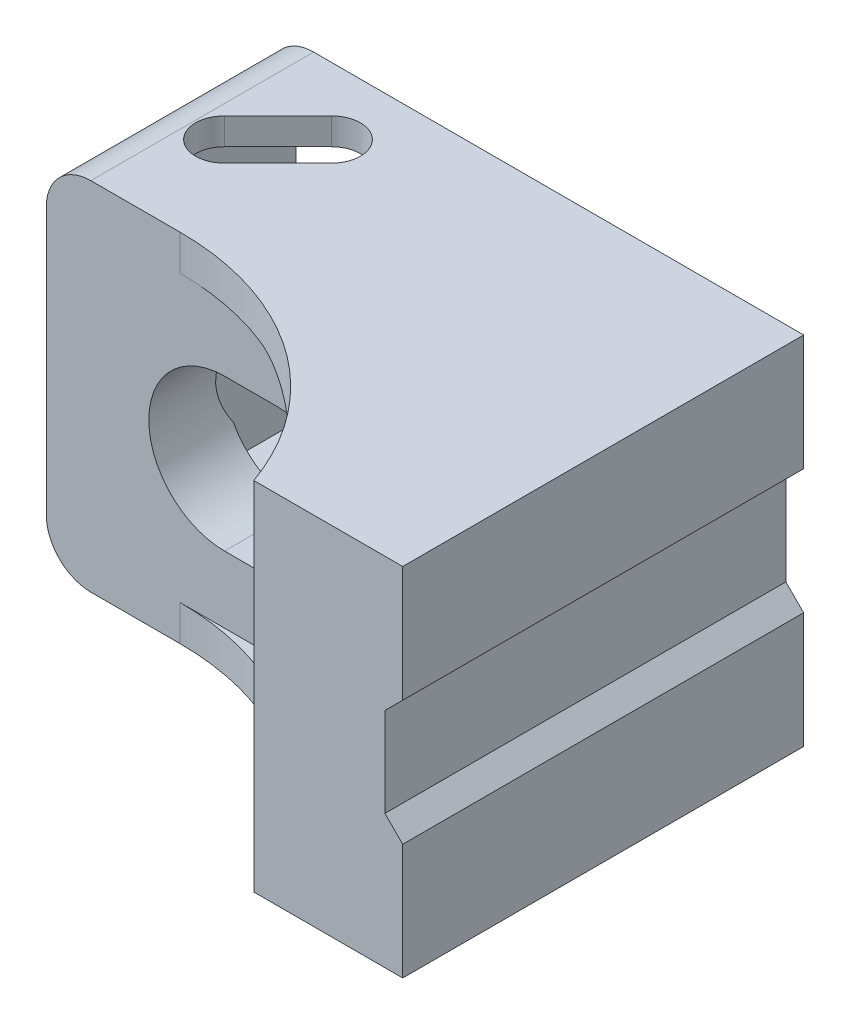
ISO-10303-21;
HEADER;
FILE_DESCRIPTION(('STEP AP214'),'2;1');
FILE_NAME('part.step','',(''),(''),'','','');
FILE_SCHEMA(('AUTOMOTIVE_DESIGN { 1 0 10303 214 1 1 1 1 }'));
ENDSEC;
DATA;
#1=APPLICATION_CONTEXT('core data for automotive mechanical design processes');
#2=APPLICATION_PROTOCOL_DEFINITION('international standard','automotive_design',2000,#1);
#3=PRODUCT_CONTEXT('',#1,'mechanical');
#4=PRODUCT('Part','Part','',(#3));
#5=PRODUCT_RELATED_PRODUCT_CATEGORY('part','',(#4));
#6=PRODUCT_DEFINITION_FORMATION('','',#4);
#7=PRODUCT_DEFINITION_CONTEXT('part definition',#1,'design');
#8=PRODUCT_DEFINITION('design','',#6,#7);
#9=PRODUCT_DEFINITION_SHAPE('','',#8);
#10=(LENGTH_UNIT() NAMED_UNIT(*) SI_UNIT(.MILLI.,.METRE.));
#11=(NAMED_UNIT(*) PLANE_ANGLE_UNIT() SI_UNIT($,.RADIAN.));
#12=(NAMED_UNIT(*) SI_UNIT($,.STERADIAN.) SOLID_ANGLE_UNIT());
#13=UNCERTAINTY_MEASURE_WITH_UNIT(LENGTH_MEASURE(1.E-05),#10,'distance_accuracy_value','');
#14=(GEOMETRIC_REPRESENTATION_CONTEXT(3) GLOBAL_UNCERTAINTY_ASSIGNED_CONTEXT((#13)) GLOBAL_UNIT_ASSIGNED_CONTEXT((#10,
#11,#12)) REPRESENTATION_CONTEXT('',''));
#15=CARTESIAN_POINT('',(0.,0.,0.));
#16=DIRECTION('',(0.,0.,1.));
#17=DIRECTION('',(1.,0.,0.));
#18=AXIS2_PLACEMENT_3D('',#15,#16,#17);
#19=CARTESIAN_POINT('',(34.,-20.,-5.00000000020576E-05));
#20=DIRECTION('',(-1.,0.,0.));
#21=DIRECTION('',(0.,-1.,0.));
#22=AXIS2_PLACEMENT_3D('',#19,#20,#21);
#23=PLANE('',#22);
#24=DIRECTION('',(0.,-1.,0.));
#25=VECTOR('',#24,1.);
#26=CARTESIAN_POINT('',(34.,17.,0.));
#27=LINE('',#26,#25);
#28=CARTESIAN_POINT('',(34.,-7.,0.));
#29=VERTEX_POINT('',#28);
#30=CARTESIAN_POINT('',(34.,-20.,0.));
#31=VERTEX_POINT('',#30);
#32=EDGE_CURVE('E308',#29,#31,#27,.T.);
#33=ORIENTED_EDGE('',*,*,#32,.F.);
#34=DIRECTION('',(0.,0.,1.));
#35=VECTOR('',#34,1.);
#36=CARTESIAN_POINT('',(34.,-7.,-5.00000000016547E-05));
#37=LINE('',#36,#35);
#38=CARTESIAN_POINT('',(34.,-7.,45.));
#39=VERTEX_POINT('',#38);
#40=EDGE_CURVE('E293',#29,#39,#37,.T.);
#41=ORIENTED_EDGE('',*,*,#40,.T.);
#42=DIRECTION('',(0.,-1.,0.));
#43=VECTOR('',#42,1.);
#44=CARTESIAN_POINT('',(34.,-20.,45.));
#45=LINE('',#44,#43);
#46=CARTESIAN_POINT('',(34.,-20.,45.));
#47=VERTEX_POINT('',#46);
#48=EDGE_CURVE('E306',#39,#47,#45,.T.);
#49=ORIENTED_EDGE('',*,*,#48,.T.);
#50=DIRECTION('',(0.,0.,1.));
#51=VECTOR('',#50,1.);
#52=CARTESIAN_POINT('',(34.,-20.,-5.00000000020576E-05));
#53=LINE('',#52,#51);
#54=EDGE_CURVE('E327',#31,#47,#53,.T.);
#55=ORIENTED_EDGE('',*,*,#54,.F.);
#56=EDGE_LOOP('',(#33,#41,#49,#55));
#57=FACE_BOUND('',#56,.T.);
#58=ADVANCED_FACE('F14',(#57),#23,.F.);
#59=CARTESIAN_POINT('',(0.,0.,16.5));
#60=DIRECTION('',(0.,0.,-1.));
#61=DIRECTION('',(1.,0.,0.));
#62=AXIS2_PLACEMENT_3D('',#59,#60,#61);
#63=CYLINDRICAL_SURFACE('',#62,10.5);
#64=CARTESIAN_POINT('',(0.,0.,9.));
#65=DIRECTION('',(0.,0.,1.));
#66=DIRECTION('',(-1.,0.,0.));
#67=AXIS2_PLACEMENT_3D('',#64,#65,#66);
#68=CIRCLE('',#67,10.5);
#69=CARTESIAN_POINT('',(0.,10.5,9.));
#70=VERTEX_POINT('',#69);
#71=CARTESIAN_POINT('',(8.94427190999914,5.5,9.));
#72=VERTEX_POINT('',#71);
#73=EDGE_CURVE('E742',#70,#72,#68,.F.);
#74=ORIENTED_EDGE('',*,*,#73,.T.);
#75=DIRECTION('',(0.,0.,-1.));
#76=VECTOR('',#75,1.);
#77=CARTESIAN_POINT('',(8.94427190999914,5.5,16.5));
#78=LINE('',#77,#76);
#79=CARTESIAN_POINT('',(8.94427190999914,5.5,16.5));
#80=VERTEX_POINT('',#79);
#81=EDGE_CURVE('E409',#80,#72,#78,.T.);
#82=ORIENTED_EDGE('',*,*,#81,.F.);
#83=CARTESIAN_POINT('',(0.,0.,16.5));
#84=DIRECTION('',(0.,0.,-1.));
#85=DIRECTION('',(1.,0.,0.));
#86=AXIS2_PLACEMENT_3D('',#83,#84,#85);
#87=CIRCLE('',#86,10.5);
#88=CARTESIAN_POINT('',(0.,10.5,16.5));
#89=VERTEX_POINT('',#88);
#90=EDGE_CURVE('E686',#89,#80,#87,.T.);
#91=ORIENTED_EDGE('',*,*,#90,.F.);
#92=DIRECTION('',(0.,0.,-1.));
#93=VECTOR('',#92,1.);
#94=CARTESIAN_POINT('',(0.,10.5,16.5));
#95=LINE('',#94,#93);
#96=EDGE_CURVE('E692',#89,#70,#95,.T.);
#97=ORIENTED_EDGE('',*,*,#96,.T.);
#98=EDGE_LOOP('',(#74,#82,#91,#97));
#99=FACE_BOUND('',#98,.T.);
#100=ADVANCED_FACE('F521',(#99),#63,.F.);
#101=CARTESIAN_POINT('',(19.4558441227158,-17.,9.));
#102=DIRECTION('',(0.,0.,1.));
#103=DIRECTION('',(-1.,0.,0.));
#104=AXIS2_PLACEMENT_3D('',#101,#102,#103);
#105=PLANE('',#104);
#106=DIRECTION('',(0.,1.,0.));
#107=VECTOR('',#106,1.);
#108=CARTESIAN_POINT('',(19.4558441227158,-17.,9.));
#109=LINE('',#108,#107);
#110=CARTESIAN_POINT('',(19.4558441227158,5.5,9.));
#111=VERTEX_POINT('',#110);
#112=CARTESIAN_POINT('',(19.4558441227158,17.,9.));
#113=VERTEX_POINT('',#112);
#114=EDGE_CURVE('E661',#111,#113,#109,.T.);
#115=ORIENTED_EDGE('',*,*,#114,.F.);
#116=DIRECTION('',(-1.,0.,0.));
#117=VECTOR('',#116,1.);
#118=CARTESIAN_POINT('',(19.4558441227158,5.5,9.));
#119=LINE('',#118,#117);
#120=EDGE_CURVE('E417',#111,#72,#119,.T.);
#121=ORIENTED_EDGE('',*,*,#120,.T.);
#122=ORIENTED_EDGE('',*,*,#73,.F.);
#123=DIRECTION('',(1.,0.,0.));
#124=VECTOR('',#123,1.);
#125=CARTESIAN_POINT('',(-23.,10.5,9.));
#126=LINE('',#125,#124);
#127=CARTESIAN_POINT('',(-6.,10.5,9.));
#128=VERTEX_POINT('',#127);
#129=EDGE_CURVE('E671',#128,#70,#126,.T.);
#130=ORIENTED_EDGE('',*,*,#129,.F.);
#131=DIRECTION('',(0.,1.,0.));
#132=VECTOR('',#131,1.);
#133=CARTESIAN_POINT('',(-6.,-17.,9.));
#134=LINE('',#133,#132);
#135=CARTESIAN_POINT('',(-6.,17.,9.));
#136=VERTEX_POINT('',#135);
#137=EDGE_CURVE('E665',#128,#136,#134,.T.);
#138=ORIENTED_EDGE('',*,*,#137,.T.);
#139=DIRECTION('',(1.,0.,0.));
#140=VECTOR('',#139,1.);
#141=CARTESIAN_POINT('',(19.4558441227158,17.,9.));
#142=LINE('',#141,#140);
#143=EDGE_CURVE('E622',#136,#113,#142,.T.);
#144=ORIENTED_EDGE('',*,*,#143,.T.);
#145=EDGE_LOOP('',(#115,#121,#122,#130,#138,#144));
#146=FACE_BOUND('',#145,.T.);
#147=ADVANCED_FACE('F500',(#146),#105,.F.);
#148=CARTESIAN_POINT('',(-6.,0.,0.));
#149=DIRECTION('',(0.,0.,1.));
#150=DIRECTION('',(-1.,0.,0.));
#151=AXIS2_PLACEMENT_3D('',#148,#149,#150);
#152=CYLINDRICAL_SURFACE('',#151,8.5);
#153=CARTESIAN_POINT('',(-6.,0.,16.5));
#154=DIRECTION('',(0.,0.,-1.));
#155=DIRECTION('',(1.,0.,0.));
#156=AXIS2_PLACEMENT_3D('',#153,#154,#155);
#157=CIRCLE('',#156,8.5);
#158=CARTESIAN_POINT('',(-13.5,-3.99999999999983,16.5));
#159=VERTEX_POINT('',#158);
#160=CARTESIAN_POINT('',(-6.,-8.5,16.5));
#161=VERTEX_POINT('',#160);
#162=EDGE_CURVE('E702',#159,#161,#157,.F.);
#163=ORIENTED_EDGE('',*,*,#162,.F.);
#164=CARTESIAN_POINT('',(-6.,0.,9.));
#165=DIRECTION('',(0.707106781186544,0.,0.707106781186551));
#166=DIRECTION('',(-0.707106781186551,0.,0.707106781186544));
#167=AXIS2_PLACEMENT_3D('',#164,#165,#166);
#168=ELLIPSE('',#167,12.0208152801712,8.5);
#169=CARTESIAN_POINT('',(-13.5,3.99999999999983,16.5));
#170=VERTEX_POINT('',#169);
#171=EDGE_CURVE('E676',#159,#170,#168,.F.);
#172=ORIENTED_EDGE('',*,*,#171,.T.);
#173=CARTESIAN_POINT('',(-6.,8.5,16.5));
#174=VERTEX_POINT('',#173);
#175=EDGE_CURVE('E703',#174,#170,#157,.F.);
#176=ORIENTED_EDGE('',*,*,#175,.F.);
#177=DIRECTION('',(0.,0.,1.));
#178=VECTOR('',#177,1.);
#179=CARTESIAN_POINT('',(-6.,8.5,0.));
#180=LINE('',#179,#178);
#181=CARTESIAN_POINT('',(-6.,8.5,25.));
#182=VERTEX_POINT('',#181);
#183=EDGE_CURVE('E718',#174,#182,#180,.T.);
#184=ORIENTED_EDGE('',*,*,#183,.T.);
#185=CARTESIAN_POINT('',(-6.,0.,25.));
#186=DIRECTION('',(0.,0.,1.));
#187=DIRECTION('',(1.,0.,0.));
#188=AXIS2_PLACEMENT_3D('',#185,#186,#187);
#189=CIRCLE('',#188,8.5);
#190=CARTESIAN_POINT('',(-6.,-8.5,25.));
#191=VERTEX_POINT('',#190);
#192=EDGE_CURVE('E706',#182,#191,#189,.T.);
#193=ORIENTED_EDGE('',*,*,#192,.T.);
#194=DIRECTION('',(0.,0.,1.));
#195=VECTOR('',#194,1.);
#196=CARTESIAN_POINT('',(-6.,-8.5,0.));
#197=LINE('',#196,#195);
#198=EDGE_CURVE('E717',#161,#191,#197,.T.);
#199=ORIENTED_EDGE('',*,*,#198,.F.);
#200=EDGE_LOOP('',(#163,#172,#176,#184,#193,#199));
#201=FACE_BOUND('',#200,.T.);
#202=ADVANCED_FACE('F529',(#201),#152,.F.);
#203=CARTESIAN_POINT('',(-6.,8.5,0.));
#204=DIRECTION('',(0.,1.,0.));
#205=DIRECTION('',(0.,0.,-1.));
#206=AXIS2_PLACEMENT_3D('',#203,#204,#205);
#207=PLANE('',#206);
#208=DIRECTION('',(-1.,0.,0.));
#209=VECTOR('',#208,1.);
#210=CARTESIAN_POINT('',(-6.,8.5,16.5));
#211=LINE('',#210,#209);
#212=CARTESIAN_POINT('',(0.,8.5,16.5));
#213=VERTEX_POINT('',#212);
#214=EDGE_CURVE('E700',#213,#174,#211,.T.);
#215=ORIENTED_EDGE('',*,*,#214,.F.);
#216=DIRECTION('',(0.,0.,1.));
#217=VECTOR('',#216,1.);
#218=CARTESIAN_POINT('',(0.,8.5,0.));
#219=LINE('',#218,#217);
#220=CARTESIAN_POINT('',(0.,8.5,25.));
#221=VERTEX_POINT('',#220);
#222=EDGE_CURVE('E721',#213,#221,#219,.T.);
#223=ORIENTED_EDGE('',*,*,#222,.T.);
#224=DIRECTION('',(-1.,0.,0.));
#225=VECTOR('',#224,1.);
#226=CARTESIAN_POINT('',(-6.,8.5,25.));
#227=LINE('',#226,#225);
#228=EDGE_CURVE('E714',#221,#182,#227,.T.);
#229=ORIENTED_EDGE('',*,*,#228,.T.);
#230=ORIENTED_EDGE('',*,*,#183,.F.);
#231=EDGE_LOOP('',(#215,#223,#229,#230));
#232=FACE_BOUND('',#231,.T.);
#233=ADVANCED_FACE('F525',(#232),#207,.F.);
#234=CARTESIAN_POINT('',(0.,0.,0.));
#235=DIRECTION('',(0.,0.,1.));
#236=DIRECTION('',(-1.,0.,0.));
#237=AXIS2_PLACEMENT_3D('',#234,#235,#236);
#238=CYLINDRICAL_SURFACE('',#237,8.5);
#239=CARTESIAN_POINT('',(0.,0.,16.5));
#240=DIRECTION('',(0.,0.,-1.));
#241=DIRECTION('',(1.,0.,0.));
#242=AXIS2_PLACEMENT_3D('',#239,#240,#241);
#243=CIRCLE('',#242,8.5);
#244=CARTESIAN_POINT('',(0.,-8.5,16.5));
#245=VERTEX_POINT('',#244);
#246=EDGE_CURVE('E696',#245,#213,#243,.F.);
#247=ORIENTED_EDGE('',*,*,#246,.F.);
#248=DIRECTION('',(0.,0.,1.));
#249=VECTOR('',#248,1.);
#250=CARTESIAN_POINT('',(0.,-8.5,0.));
#251=LINE('',#250,#249);
#252=CARTESIAN_POINT('',(0.,-8.5,25.));
#253=VERTEX_POINT('',#252);
#254=EDGE_CURVE('E723',#245,#253,#251,.T.);
#255=ORIENTED_EDGE('',*,*,#254,.T.);
#256=CARTESIAN_POINT('',(0.,0.,25.));
#257=DIRECTION('',(0.,0.,1.));
#258=DIRECTION('',(-1.,0.,0.));
#259=AXIS2_PLACEMENT_3D('',#256,#257,#258);
#260=CIRCLE('',#259,8.5);
#261=EDGE_CURVE('E711',#253,#221,#260,.T.);
#262=ORIENTED_EDGE('',*,*,#261,.T.);
#263=ORIENTED_EDGE('',*,*,#222,.F.);
#264=EDGE_LOOP('',(#247,#255,#262,#263));
#265=FACE_BOUND('',#264,.T.);
#266=ADVANCED_FACE('F528',(#265),#238,.F.);
#267=CARTESIAN_POINT('',(-6.,-8.5,0.));
#268=DIRECTION('',(0.,-1.,0.));
#269=DIRECTION('',(0.,0.,1.));
#270=AXIS2_PLACEMENT_3D('',#267,#268,#269);
#271=PLANE('',#270);
#272=DIRECTION('',(1.,0.,0.));
#273=VECTOR('',#272,1.);
#274=CARTESIAN_POINT('',(-6.,-8.5,16.5));
#275=LINE('',#274,#273);
#276=EDGE_CURVE('E738',#161,#245,#275,.T.);
#277=ORIENTED_EDGE('',*,*,#276,.F.);
#278=ORIENTED_EDGE('',*,*,#198,.T.);
#279=DIRECTION('',(1.,0.,0.));
#280=VECTOR('',#279,1.);
#281=CARTESIAN_POINT('',(-6.,-8.5,25.));
#282=LINE('',#281,#280);
#283=EDGE_CURVE('E708',#191,#253,#282,.T.);
#284=ORIENTED_EDGE('',*,*,#283,.T.);
#285=ORIENTED_EDGE('',*,*,#254,.F.);
#286=EDGE_LOOP('',(#277,#278,#284,#285));
#287=FACE_BOUND('',#286,.T.);
#288=ADVANCED_FACE('F533',(#287),#271,.F.);
#289=CARTESIAN_POINT('',(37.,17.,0.));
#290=DIRECTION('',(0.,0.,1.));
#291=DIRECTION('',(-1.,0.,0.));
#292=AXIS2_PLACEMENT_3D('',#289,#290,#291);
#293=PLANE('',#292);
#294=DIRECTION('',(-1.,0.,0.));
#295=VECTOR('',#294,1.);
#296=CARTESIAN_POINT('',(37.,17.,0.));
#297=LINE('',#296,#295);
#298=CARTESIAN_POINT('',(28.4558441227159,17.,0.));
#299=VERTEX_POINT('',#298);
#300=CARTESIAN_POINT('',(-23.,17.,0.));
#301=VERTEX_POINT('',#300);
#302=EDGE_CURVE('E614',#299,#301,#297,.T.);
#303=ORIENTED_EDGE('',*,*,#302,.T.);
#304=DIRECTION('',(0.,-1.,0.));
#305=VECTOR('',#304,1.);
#306=CARTESIAN_POINT('',(-23.,-20.,0.));
#307=LINE('',#306,#305);
#308=CARTESIAN_POINT('',(-23.,-17.,0.));
#309=VERTEX_POINT('',#308);
#310=EDGE_CURVE('E590',#301,#309,#307,.T.);
#311=ORIENTED_EDGE('',*,*,#310,.T.);
#312=DIRECTION('',(-1.,0.,0.));
#313=VECTOR('',#312,1.);
#314=CARTESIAN_POINT('',(37.,-17.,0.));
#315=LINE('',#314,#313);
#316=CARTESIAN_POINT('',(28.4558441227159,-17.,0.));
#317=VERTEX_POINT('',#316);
#318=EDGE_CURVE('E608',#317,#309,#315,.T.);
#319=ORIENTED_EDGE('',*,*,#318,.F.);
#320=DIRECTION('',(0.,1.,0.));
#321=VECTOR('',#320,1.);
#322=CARTESIAN_POINT('',(28.4558441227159,-17.,0.));
#323=LINE('',#322,#321);
#324=EDGE_CURVE('E638',#317,#299,#323,.T.);
#325=ORIENTED_EDGE('',*,*,#324,.T.);
#326=EDGE_LOOP('',(#303,#311,#319,#325));
#327=FACE_BOUND('',#326,.T.);
#328=DIRECTION('',(-1.,0.,0.));
#329=VECTOR('',#328,1.);
#330=CARTESIAN_POINT('',(37.,-20.,0.));
#331=LINE('',#330,#329);
#332=CARTESIAN_POINT('',(-21.,-20.,0.));
#333=VERTEX_POINT('',#332);
#334=EDGE_CURVE('E618',#31,#333,#331,.T.);
#335=ORIENTED_EDGE('',*,*,#334,.T.);
#336=CARTESIAN_POINT('',(-21.,-15.,0.));
#337=DIRECTION('',(0.,0.,1.));
#338=DIRECTION('',(-1.,0.,0.));
#339=AXIS2_PLACEMENT_3D('',#336,#337,#338);
#340=CIRCLE('',#339,5.);
#341=CARTESIAN_POINT('',(-26.,-15.,0.));
#342=VERTEX_POINT('',#341);
#343=EDGE_CURVE('E22',#333,#342,#340,.F.);
#344=ORIENTED_EDGE('',*,*,#343,.T.);
#345=DIRECTION('',(0.,-1.,0.));
#346=VECTOR('',#345,1.);
#347=CARTESIAN_POINT('',(-26.,-20.,0.));
#348=LINE('',#347,#346);
#349=CARTESIAN_POINT('',(-26.,15.,0.));
#350=VERTEX_POINT('',#349);
#351=EDGE_CURVE('E593',#350,#342,#348,.T.);
#352=ORIENTED_EDGE('',*,*,#351,.F.);
#353=CARTESIAN_POINT('',(-21.,15.,0.));
#354=DIRECTION('',(0.,0.,1.));
#355=DIRECTION('',(-1.,0.,0.));
#356=AXIS2_PLACEMENT_3D('',#353,#354,#355);
#357=CIRCLE('',#356,5.);
#358=CARTESIAN_POINT('',(-21.,20.,0.));
#359=VERTEX_POINT('',#358);
#360=EDGE_CURVE('E29',#350,#359,#357,.F.);
#361=ORIENTED_EDGE('',*,*,#360,.T.);
#362=DIRECTION('',(-1.,0.,0.));
#363=VECTOR('',#362,1.);
#364=CARTESIAN_POINT('',(37.,20.,0.));
#365=LINE('',#364,#363);
#366=CARTESIAN_POINT('',(34.,20.,0.));
#367=VERTEX_POINT('',#366);
#368=EDGE_CURVE('E750',#367,#359,#365,.T.);
#369=ORIENTED_EDGE('',*,*,#368,.F.);
#370=CARTESIAN_POINT('',(34.,7.,0.));
#371=VERTEX_POINT('',#370);
#372=EDGE_CURVE('E330',#367,#371,#27,.T.);
#373=ORIENTED_EDGE('',*,*,#372,.T.);
#374=DIRECTION('',(-0.707106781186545,-0.70710678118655,0.));
#375=VECTOR('',#374,1.);
#376=CARTESIAN_POINT('',(40.5,13.5,0.));
#377=LINE('',#376,#375);
#378=CARTESIAN_POINT('',(32.,5.,0.));
#379=VERTEX_POINT('',#378);
#380=EDGE_CURVE('E1102',#371,#379,#377,.T.);
#381=ORIENTED_EDGE('',*,*,#380,.T.);
#382=DIRECTION('',(0.,-1.,0.));
#383=VECTOR('',#382,1.);
#384=CARTESIAN_POINT('',(32.,17.,0.));
#385=LINE('',#384,#383);
#386=CARTESIAN_POINT('',(32.,-5.,0.));
#387=VERTEX_POINT('',#386);
#388=EDGE_CURVE('E318',#379,#387,#385,.T.);
#389=ORIENTED_EDGE('',*,*,#388,.T.);
#390=DIRECTION('',(0.707106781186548,-0.707106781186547,0.));
#391=VECTOR('',#390,1.);
#392=CARTESIAN_POINT('',(23.5,3.5,0.));
#393=LINE('',#392,#391);
#394=EDGE_CURVE('E323',#387,#29,#393,.T.);
#395=ORIENTED_EDGE('',*,*,#394,.T.);
#396=ORIENTED_EDGE('',*,*,#32,.T.);
#397=EDGE_LOOP('',(#335,#344,#352,#361,#369,#373,#381,#389,#395,#396));
#398=FACE_BOUND('',#397,.T.);
#399=ADVANCED_FACE('F16',(#327,#398),#293,.F.);
#400=CARTESIAN_POINT('',(0.,0.,25.));
#401=DIRECTION('',(0.,0.,1.));
#402=DIRECTION('',(-1.,0.,0.));
#403=AXIS2_PLACEMENT_3D('',#400,#401,#402);
#404=PLANE('',#403);
#405=ORIENTED_EDGE('',*,*,#283,.F.);
#406=ORIENTED_EDGE('',*,*,#192,.F.);
#407=ORIENTED_EDGE('',*,*,#228,.F.);
#408=ORIENTED_EDGE('',*,*,#261,.F.);
#409=EDGE_LOOP('',(#405,#406,#407,#408));
#410=FACE_BOUND('',#409,.T.);
#411=DIRECTION('',(0.,1.,0.));
#412=VECTOR('',#411,1.);
#413=CARTESIAN_POINT('',(-26.,-20.,25.));
#414=LINE('',#413,#412);
#415=CARTESIAN_POINT('',(-26.,-15.,25.));
#416=VERTEX_POINT('',#415);
#417=CARTESIAN_POINT('',(-26.,15.,25.));
#418=VERTEX_POINT('',#417);
#419=EDGE_CURVE('E436',#416,#418,#414,.T.);
#420=ORIENTED_EDGE('',*,*,#419,.F.);
#421=CARTESIAN_POINT('',(-21.,-15.,25.));
#422=DIRECTION('',(0.,0.,1.));
#423=DIRECTION('',(-1.,0.,0.));
#424=AXIS2_PLACEMENT_3D('',#421,#422,#423);
#425=CIRCLE('',#424,5.);
#426=CARTESIAN_POINT('',(-21.,-20.,25.));
#427=VERTEX_POINT('',#426);
#428=EDGE_CURVE('E768',#416,#427,#425,.T.);
#429=ORIENTED_EDGE('',*,*,#428,.T.);
#430=DIRECTION('',(-1.,0.,0.));
#431=VECTOR('',#430,1.);
#432=CARTESIAN_POINT('',(-11.,-20.,25.));
#433=LINE('',#432,#431);
#434=CARTESIAN_POINT('',(-11.,-20.,25.));
#435=VERTEX_POINT('',#434);
#436=EDGE_CURVE('E429',#435,#427,#433,.T.);
#437=ORIENTED_EDGE('',*,*,#436,.F.);
#438=DIRECTION('',(0.,1.,0.));
#439=VECTOR('',#438,1.);
#440=CARTESIAN_POINT('',(-11.,-20.,25.));
#441=LINE('',#440,#439);
#442=CARTESIAN_POINT('',(-11.,-16.,25.));
#443=VERTEX_POINT('',#442);
#444=EDGE_CURVE('E439',#435,#443,#441,.T.);
#445=ORIENTED_EDGE('',*,*,#444,.T.);
#446=DIRECTION('',(1.,0.,0.));
#447=VECTOR('',#446,1.);
#448=CARTESIAN_POINT('',(0.,-16.,25.));
#449=LINE('',#448,#447);
#450=CARTESIAN_POINT('',(0.,-16.,25.));
#451=VERTEX_POINT('',#450);
#452=EDGE_CURVE('E732',#443,#451,#449,.T.);
#453=ORIENTED_EDGE('',*,*,#452,.T.);
#454=CARTESIAN_POINT('',(0.,0.,25.));
#455=DIRECTION('',(0.,0.,1.));
#456=DIRECTION('',(-1.,0.,0.));
#457=AXIS2_PLACEMENT_3D('',#454,#455,#456);
#458=CIRCLE('',#457,16.);
#459=CARTESIAN_POINT('',(0.,16.,25.));
#460=VERTEX_POINT('',#459);
#461=EDGE_CURVE('E720',#451,#460,#458,.T.);
#462=ORIENTED_EDGE('',*,*,#461,.T.);
#463=DIRECTION('',(-1.,0.,0.));
#464=VECTOR('',#463,1.);
#465=CARTESIAN_POINT('',(0.,16.,25.));
#466=LINE('',#465,#464);
#467=CARTESIAN_POINT('',(-11.,16.,25.));
#468=VERTEX_POINT('',#467);
#469=EDGE_CURVE('E729',#460,#468,#466,.T.);
#470=ORIENTED_EDGE('',*,*,#469,.T.);
#471=CARTESIAN_POINT('',(-11.,20.,25.));
#472=VERTEX_POINT('',#471);
#473=EDGE_CURVE('E431',#468,#472,#441,.T.);
#474=ORIENTED_EDGE('',*,*,#473,.T.);
#475=DIRECTION('',(-1.,0.,0.));
#476=VECTOR('',#475,1.);
#477=CARTESIAN_POINT('',(-11.,20.,25.));
#478=LINE('',#477,#476);
#479=CARTESIAN_POINT('',(-21.,20.,25.));
#480=VERTEX_POINT('',#479);
#481=EDGE_CURVE('E423',#472,#480,#478,.T.);
#482=ORIENTED_EDGE('',*,*,#481,.T.);
#483=CARTESIAN_POINT('',(-21.,15.,25.));
#484=DIRECTION('',(0.,0.,1.));
#485=DIRECTION('',(-1.,0.,0.));
#486=AXIS2_PLACEMENT_3D('',#483,#484,#485);
#487=CIRCLE('',#486,5.);
#488=EDGE_CURVE('E765',#480,#418,#487,.T.);
#489=ORIENTED_EDGE('',*,*,#488,.T.);
#490=EDGE_LOOP('',(#420,#429,#437,#445,#453,#462,#470,#474,#482,#489));
#491=FACE_BOUND('',#490,.T.);
#492=ADVANCED_FACE('F541',(#410,#491),#404,.T.);
#493=CARTESIAN_POINT('',(0.,0.,25.));
#494=DIRECTION('',(0.,0.,1.));
#495=DIRECTION('',(-1.,0.,0.));
#496=AXIS2_PLACEMENT_3D('',#493,#494,#495);
#497=CYLINDRICAL_SURFACE('',#496,16.);
#498=DIRECTION('',(0.,0.,1.));
#499=VECTOR('',#498,1.);
#500=CARTESIAN_POINT('',(0.,-16.,25.));
#501=LINE('',#500,#499);
#502=CARTESIAN_POINT('',(0.,-16.,27.0894285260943));
#503=VERTEX_POINT('',#502);
#504=EDGE_CURVE('E735',#451,#503,#501,.T.);
#505=ORIENTED_EDGE('',*,*,#504,.T.);
#506=CARTESIAN_POINT('',(0.,-16.,27.0894285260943));
#507=CARTESIAN_POINT('',(0.239132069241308,-16.0000010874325,27.1836695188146));
#508=CARTESIAN_POINT('',(0.477003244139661,-15.9946383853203,27.2809746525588));
#509=CARTESIAN_POINT('',(0.949743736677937,-15.9735394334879,27.4814699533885));
#510=CARTESIAN_POINT('',(1.18461353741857,-15.9578048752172,27.5846591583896));
#511=CARTESIAN_POINT('',(1.88336309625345,-15.8956386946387,27.9023927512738));
#512=CARTESIAN_POINT('',(2.34215936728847,-15.8342422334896,28.1254094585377));
#513=CARTESIAN_POINT('',(3.23855836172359,-15.6753690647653,28.5894704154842));
#514=CARTESIAN_POINT('',(3.67631500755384,-15.5782230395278,28.8303337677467));
#515=CARTESIAN_POINT('',(4.5330269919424,-15.3508361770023,29.329569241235));
#516=CARTESIAN_POINT('',(4.95197397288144,-15.220580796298,29.5879490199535));
#517=CARTESIAN_POINT('',(5.85752041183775,-14.8985758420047,30.1771218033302));
#518=CARTESIAN_POINT('',(6.33922050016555,-14.6996223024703,30.5115128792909));
#519=CARTESIAN_POINT('',(7.27057968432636,-14.2619615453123,31.1983004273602));
#520=CARTESIAN_POINT('',(7.7202339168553,-14.0232483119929,31.5506996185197));
#521=CARTESIAN_POINT('',(8.5886318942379,-13.508931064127,32.2710500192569));
#522=CARTESIAN_POINT('',(9.00722848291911,-13.2331669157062,32.6390637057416));
#523=CARTESIAN_POINT('',(9.81100924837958,-12.6487559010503,33.385130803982));
#524=CARTESIAN_POINT('',(10.1961958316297,-12.3401114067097,33.7631834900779));
#525=CARTESIAN_POINT('',(10.9389051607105,-11.6871140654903,34.5311439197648));
#526=CARTESIAN_POINT('',(11.295914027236,-11.3422868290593,34.9211445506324));
#527=CARTESIAN_POINT('',(11.975766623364,-10.6219768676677,35.7027849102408));
#528=CARTESIAN_POINT('',(12.2986024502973,-10.246487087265,36.0944249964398));
#529=CARTESIAN_POINT('',(12.9091347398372,-9.46569155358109,36.8727577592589));
#530=CARTESIAN_POINT('',(13.1969249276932,-9.06047018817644,37.2594610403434));
#531=CARTESIAN_POINT('',(13.6023742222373,-8.42839898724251,37.8309033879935));
#532=CARTESIAN_POINT('',(13.7331323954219,-8.21370521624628,38.0199190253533));
#533=CARTESIAN_POINT('',(13.9857634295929,-7.77575425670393,38.3939023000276));
#534=CARTESIAN_POINT('',(14.1076374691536,-7.55249821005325,38.5788704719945));
#535=CARTESIAN_POINT('',(14.3382880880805,-7.10456132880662,38.9371542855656));
#536=CARTESIAN_POINT('',(14.447367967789,-6.8801831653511,39.1106524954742));
#537=CARTESIAN_POINT('',(14.6566344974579,-6.42233691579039,39.4508212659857));
#538=CARTESIAN_POINT('',(14.7568229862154,-6.18887072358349,39.6174932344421));
#539=CARTESIAN_POINT('',(14.947887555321,-5.71197679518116,39.9420253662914));
#540=CARTESIAN_POINT('',(15.0387590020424,-5.46854418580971,40.0998811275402));
#541=CARTESIAN_POINT('',(15.2104443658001,-4.97107724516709,40.404004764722));
#542=CARTESIAN_POINT('',(15.2912592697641,-4.71704395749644,40.5502737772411));
#543=CARTESIAN_POINT('',(15.4308703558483,-4.23573902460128,40.8074921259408));
#544=CARTESIAN_POINT('',(15.4911579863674,-4.0099938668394,40.9204773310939));
#545=CARTESIAN_POINT('',(15.6029849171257,-3.55005091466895,41.1329309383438));
#546=CARTESIAN_POINT('',(15.6545239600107,-3.31585287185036,41.2323989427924));
#547=CARTESIAN_POINT('',(15.7478457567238,-2.83972805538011,41.4145955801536));
#548=CARTESIAN_POINT('',(15.7896510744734,-2.59782066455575,41.4973628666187));
#549=CARTESIAN_POINT('',(15.8626594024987,-2.10656468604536,41.6431959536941));
#550=CARTESIAN_POINT('',(15.8938662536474,-1.85721882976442,41.7062688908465));
#551=CARTESIAN_POINT('',(15.9391981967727,-1.40759921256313,41.7984233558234));
#552=CARTESIAN_POINT('',(15.9555625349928,-1.20845200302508,41.8319147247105));
#553=CARTESIAN_POINT('',(15.9808577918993,-0.807746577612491,41.8838207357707));
#554=CARTESIAN_POINT('',(15.9897903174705,-0.606188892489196,41.9022386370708));
#555=CARTESIAN_POINT('',(15.9999985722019,-0.202146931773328,41.9232948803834));
#556=CARTESIAN_POINT('',(16.0012779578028,0.000336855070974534,41.9259407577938));
#557=CARTESIAN_POINT('',(15.9961573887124,0.404794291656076,41.9153708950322));
#558=CARTESIAN_POINT('',(15.9897571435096,0.606767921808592,41.9021545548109));
#559=CARTESIAN_POINT('',(15.9694738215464,1.00802514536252,41.8604409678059));
#560=CARTESIAN_POINT('',(15.9556169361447,1.20731566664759,41.8319972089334));
#561=CARTESIAN_POINT('',(15.9207630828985,1.6027371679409,41.7608886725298));
#562=CARTESIAN_POINT('',(15.8997632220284,1.79886683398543,41.7182181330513));
#563=CARTESIAN_POINT('',(15.8266280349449,2.3813473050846,41.5707742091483));
#564=CARTESIAN_POINT('',(15.7643656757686,2.76163030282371,41.4465868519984));
#565=CARTESIAN_POINT('',(15.627614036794,3.44695756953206,41.1801212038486));
#566=CARTESIAN_POINT('',(15.5562806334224,3.7548286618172,41.043209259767));
#567=CARTESIAN_POINT('',(15.3987372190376,4.356081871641,40.7474645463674));
#568=CARTESIAN_POINT('',(15.312516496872,4.64945336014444,40.5886160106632));
#569=CARTESIAN_POINT('',(15.1264808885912,5.22310656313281,40.2540255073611));
#570=CARTESIAN_POINT('',(15.0266233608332,5.5033433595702,40.0782310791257));
#571=CARTESIAN_POINT('',(14.8146439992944,6.05082309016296,39.7144353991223));
#572=CARTESIAN_POINT('',(14.702523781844,6.31806773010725,39.5264357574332));
#573=CARTESIAN_POINT('',(14.4752551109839,6.8218579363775,39.1552755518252));
#574=CARTESIAN_POINT('',(14.3609049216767,7.05922884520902,38.972740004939));
#575=CARTESIAN_POINT('',(14.1226830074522,7.52450245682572,38.6018478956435));
#576=CARTESIAN_POINT('',(13.9988097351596,7.7524036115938,38.4134903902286));
#577=CARTESIAN_POINT('',(13.7417638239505,8.19941693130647,38.032443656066));
#578=CARTESIAN_POINT('',(13.6085858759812,8.41852396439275,37.8397519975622));
#579=CARTESIAN_POINT('',(13.3331697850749,8.84825923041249,37.4513939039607));
#580=CARTESIAN_POINT('',(13.1909306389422,9.05888652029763,37.2557271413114));
#581=CARTESIAN_POINT('',(12.7503326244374,9.67919445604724,36.665255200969));
#582=CARTESIAN_POINT('',(12.4384698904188,10.0766493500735,36.2675422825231));
#583=CARTESIAN_POINT('',(11.7793682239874,10.8397632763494,35.4713620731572));
#584=CARTESIAN_POINT('',(11.4321388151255,11.205430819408,35.0728950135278));
#585=CARTESIAN_POINT('',(10.68079084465,11.9250514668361,34.2570862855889));
#586=CARTESIAN_POINT('',(10.2745340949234,12.2770729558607,33.8400015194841));
#587=CARTESIAN_POINT('',(9.42199397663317,12.9428949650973,33.0160586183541));
#588=CARTESIAN_POINT('',(8.97570427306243,13.2566894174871,32.609202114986));
#589=CARTESIAN_POINT('',(8.04560143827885,13.8408226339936,31.8129775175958));
#590=CARTESIAN_POINT('',(7.56198403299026,14.1113679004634,31.4235331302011));
#591=CARTESIAN_POINT('',(6.55617548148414,14.6058320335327,30.6653141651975));
#592=CARTESIAN_POINT('',(6.03399493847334,14.8297636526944,30.2965339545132));
#593=CARTESIAN_POINT('',(5.07625425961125,15.179893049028,29.666150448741));
#594=CARTESIAN_POINT('',(4.64803755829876,15.3167347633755,29.3992605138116));
#595=CARTESIAN_POINT('',(3.77151656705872,15.5557628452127,28.8837139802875));
#596=CARTESIAN_POINT('',(3.32322260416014,15.6579668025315,28.6350481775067));
#597=CARTESIAN_POINT('',(2.63539043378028,15.7832122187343,28.2765273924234));
#598=CARTESIAN_POINT('',(2.40237528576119,15.8203952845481,28.1588967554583));
#599=CARTESIAN_POINT('',(1.93221670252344,15.8846723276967,27.9292375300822));
#600=CARTESIAN_POINT('',(1.69507345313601,15.91176675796,27.8172086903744));
#601=CARTESIAN_POINT('',(1.21675629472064,15.9554773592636,27.5989041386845));
#602=CARTESIAN_POINT('',(0.975576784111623,15.9720774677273,27.4926374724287));
#603=CARTESIAN_POINT('',(0.490033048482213,15.9943422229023,27.2863053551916));
#604=CARTESIAN_POINT('',(0.245668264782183,16.0000049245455,27.18624101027));
#605=CARTESIAN_POINT('',(0.,16.,27.0894285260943));
#606=B_SPLINE_CURVE_WITH_KNOTS('',3,(#506,#507,#508,#509,#510,#511,#512,#513,#514,#515,#516,
#517,#518,#519,#520,#521,#522,#523,#524,#525,#526,#527,#528,#529,#530,#531,#532,#533,#534,#535,
#536,#537,#538,#539,#540,#541,#542,#543,#544,#545,#546,#547,#548,#549,#550,#551,#552,#553,#554,
#555,#556,#557,#558,#559,#560,#561,#562,#563,#564,#565,#566,#567,#568,#569,#570,#571,#572,#573,
#574,#575,#576,#577,#578,#579,#580,#581,#582,#583,#584,#585,#586,#587,#588,#589,#590,#591,#592,
#593,#594,#595,#596,#597,#598,#599,#600,#601,#602,#603,#604,#605),.UNSPECIFIED.,.F.,.F.,(4,2,2,
2,2,2,2,2,2,2,2,2,2,2,2,2,2,2,2,2,2,2,2,2,2,2,2,2,2,2,2,2,2,2,2,2,2,2,2,2,2,2,2,2,2,2,2,2,2,4),
(0.,0.77092853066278,1.54173136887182,3.08084332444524,4.60606242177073,6.13195263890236,
7.98697570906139,9.84227970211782,11.7058769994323,13.5693399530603,15.461335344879,
17.3537673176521,19.2410215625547,20.1843452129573,21.1275434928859,22.0388927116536,
22.9500530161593,23.8616642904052,24.7731860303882,25.5512666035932,26.3293700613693,
27.1056514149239,27.8816511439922,28.4888171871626,29.0958519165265,29.7025965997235,
30.3093642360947,30.914014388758,31.5189097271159,32.7291769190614,33.7610163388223,
34.7936012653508,35.8294923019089,36.8652469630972,37.8264813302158,38.7878722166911,
39.7498162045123,40.7118668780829,42.6387825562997,44.5651807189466,46.60409331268,
48.6433291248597,50.6725169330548,52.7011488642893,54.267951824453,55.8339579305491,
56.6246982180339,57.4154030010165,58.2073151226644,58.9993680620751),.UNSPECIFIED.);
#607=CARTESIAN_POINT('',(0.,16.,27.0894285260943));
#608=VERTEX_POINT('',#607);
#609=EDGE_CURVE('E444',#503,#608,#606,.T.);
#610=ORIENTED_EDGE('',*,*,#609,.T.);
#611=DIRECTION('',(0.,0.,1.));
#612=VECTOR('',#611,1.);
#613=CARTESIAN_POINT('',(0.,16.,25.));
#614=LINE('',#613,#612);
#615=EDGE_CURVE('E734',#460,#608,#614,.T.);
#616=ORIENTED_EDGE('',*,*,#615,.F.);
#617=ORIENTED_EDGE('',*,*,#461,.F.);
#618=EDGE_LOOP('',(#505,#610,#616,#617));
#619=FACE_BOUND('',#618,.T.);
#620=ADVANCED_FACE('F454',(#619),#497,.F.);
#621=CARTESIAN_POINT('',(0.,-16.,25.));
#622=DIRECTION('',(0.,-1.,0.));
#623=DIRECTION('',(1.,0.,0.));
#624=AXIS2_PLACEMENT_3D('',#621,#622,#623);
#625=PLANE('',#624);
#626=ORIENTED_EDGE('',*,*,#452,.F.);
#627=CARTESIAN_POINT('',(-11.,-16.,55.));
#628=DIRECTION('',(0.,-1.,0.));
#629=DIRECTION('',(1.,0.,0.));
#630=AXIS2_PLACEMENT_3D('',#627,#628,#629);
#631=CIRCLE('',#630,30.);
#632=EDGE_CURVE('E452',#443,#503,#631,.T.);
#633=ORIENTED_EDGE('',*,*,#632,.T.);
#634=ORIENTED_EDGE('',*,*,#504,.F.);
#635=EDGE_LOOP('',(#626,#633,#634));
#636=FACE_BOUND('',#635,.T.);
#637=ADVANCED_FACE('F545',(#636),#625,.F.);
#638=CARTESIAN_POINT('',(0.,16.,25.));
#639=DIRECTION('',(0.,1.,0.));
#640=DIRECTION('',(-1.,0.,0.));
#641=AXIS2_PLACEMENT_3D('',#638,#639,#640);
#642=PLANE('',#641);
#643=ORIENTED_EDGE('',*,*,#615,.T.);
#644=CARTESIAN_POINT('',(-11.,16.,55.));
#645=DIRECTION('',(0.,1.,0.));
#646=DIRECTION('',(-1.,0.,0.));
#647=AXIS2_PLACEMENT_3D('',#644,#645,#646);
#648=CIRCLE('',#647,30.);
#649=EDGE_CURVE('E435',#608,#468,#648,.T.);
#650=ORIENTED_EDGE('',*,*,#649,.T.);
#651=ORIENTED_EDGE('',*,*,#469,.F.);
#652=EDGE_LOOP('',(#643,#650,#651));
#653=FACE_BOUND('',#652,.T.);
#654=ADVANCED_FACE('F512',(#653),#642,.F.);
#655=CARTESIAN_POINT('',(0.,0.,16.5));
#656=DIRECTION('',(0.,0.,-1.));
#657=DIRECTION('',(1.,0.,0.));
#658=AXIS2_PLACEMENT_3D('',#655,#656,#657);
#659=PLANE('',#658);
#660=DIRECTION('',(0.,-1.,0.));
#661=VECTOR('',#660,1.);
#662=CARTESIAN_POINT('',(-13.5,0.,16.5));
#663=LINE('',#662,#661);
#664=CARTESIAN_POINT('',(-13.5,10.5,16.5));
#665=VERTEX_POINT('',#664);
#666=EDGE_CURVE('E677',#665,#170,#663,.T.);
#667=ORIENTED_EDGE('',*,*,#666,.F.);
#668=DIRECTION('',(1.,0.,0.));
#669=VECTOR('',#668,1.);
#670=CARTESIAN_POINT('',(-23.,10.5,16.5));
#671=LINE('',#670,#669);
#672=EDGE_CURVE('E683',#665,#89,#671,.T.);
#673=ORIENTED_EDGE('',*,*,#672,.T.);
#674=ORIENTED_EDGE('',*,*,#90,.T.);
#675=DIRECTION('',(1.,0.,0.));
#676=VECTOR('',#675,1.);
#677=CARTESIAN_POINT('',(20.,5.5,16.5));
#678=LINE('',#677,#676);
#679=CARTESIAN_POINT('',(20.,5.5,16.5));
#680=VERTEX_POINT('',#679);
#681=EDGE_CURVE('E401',#80,#680,#678,.T.);
#682=ORIENTED_EDGE('',*,*,#681,.T.);
#683=CARTESIAN_POINT('',(20.,0.,16.5));
#684=DIRECTION('',(0.,0.,-1.));
#685=DIRECTION('',(1.,0.,0.));
#686=AXIS2_PLACEMENT_3D('',#683,#684,#685);
#687=CIRCLE('',#686,5.5);
#688=CARTESIAN_POINT('',(20.,-5.5,16.5));
#689=VERTEX_POINT('',#688);
#690=EDGE_CURVE('E395',#680,#689,#687,.T.);
#691=ORIENTED_EDGE('',*,*,#690,.T.);
#692=DIRECTION('',(-1.,0.,0.));
#693=VECTOR('',#692,1.);
#694=CARTESIAN_POINT('',(20.,-5.5,16.5));
#695=LINE('',#694,#693);
#696=CARTESIAN_POINT('',(8.94427190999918,-5.5,16.5));
#697=VERTEX_POINT('',#696);
#698=EDGE_CURVE('E398',#689,#697,#695,.T.);
#699=ORIENTED_EDGE('',*,*,#698,.T.);
#700=CARTESIAN_POINT('',(0.,-10.5,16.5));
#701=VERTEX_POINT('',#700);
#702=EDGE_CURVE('E685',#697,#701,#87,.T.);
#703=ORIENTED_EDGE('',*,*,#702,.T.);
#704=DIRECTION('',(-1.,0.,0.));
#705=VECTOR('',#704,1.);
#706=CARTESIAN_POINT('',(-23.,-10.5,16.5));
#707=LINE('',#706,#705);
#708=CARTESIAN_POINT('',(-13.5,-10.5,16.5));
#709=VERTEX_POINT('',#708);
#710=EDGE_CURVE('E689',#701,#709,#707,.T.);
#711=ORIENTED_EDGE('',*,*,#710,.T.);
#712=EDGE_CURVE('E674',#159,#709,#663,.T.);
#713=ORIENTED_EDGE('',*,*,#712,.F.);
#714=ORIENTED_EDGE('',*,*,#162,.T.);
#715=ORIENTED_EDGE('',*,*,#276,.T.);
#716=ORIENTED_EDGE('',*,*,#246,.T.);
#717=ORIENTED_EDGE('',*,*,#214,.T.);
#718=ORIENTED_EDGE('',*,*,#175,.T.);
#719=EDGE_LOOP('',(#667,#673,#674,#682,#691,#699,#703,#711,#713,#714,#715,#716,#717,#718));
#720=FACE_BOUND('',#719,.T.);
#721=ADVANCED_FACE('F508',(#720),#659,.T.);
#722=CARTESIAN_POINT('',(-23.,10.5,16.5));
#723=DIRECTION('',(0.,1.,0.));
#724=DIRECTION('',(0.,0.,-1.));
#725=AXIS2_PLACEMENT_3D('',#722,#723,#724);
#726=PLANE('',#725);
#727=DIRECTION('',(0.707106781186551,0.,-0.707106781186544));
#728=VECTOR('',#727,1.);
#729=CARTESIAN_POINT('',(-18.25,10.5,21.25));
#730=LINE('',#729,#728);
#731=EDGE_CURVE('E680',#665,#128,#730,.T.);
#732=ORIENTED_EDGE('',*,*,#731,.T.);
#733=ORIENTED_EDGE('',*,*,#129,.T.);
#734=ORIENTED_EDGE('',*,*,#96,.F.);
#735=ORIENTED_EDGE('',*,*,#672,.F.);
#736=EDGE_LOOP('',(#732,#733,#734,#735));
#737=FACE_BOUND('',#736,.T.);
#738=ADVANCED_FACE('F511',(#737),#726,.F.);
#739=CARTESIAN_POINT('',(-23.,-10.5,16.5));
#740=DIRECTION('',(0.,-1.,0.));
#741=DIRECTION('',(1.,0.,0.));
#742=AXIS2_PLACEMENT_3D('',#739,#740,#741);
#743=PLANE('',#742);
#744=DIRECTION('',(0.,0.,-1.));
#745=VECTOR('',#744,1.);
#746=CARTESIAN_POINT('',(0.,-10.5,16.5));
#747=LINE('',#746,#745);
#748=CARTESIAN_POINT('',(0.,-10.5,9.));
#749=VERTEX_POINT('',#748);
#750=EDGE_CURVE('E693',#701,#749,#747,.T.);
#751=ORIENTED_EDGE('',*,*,#750,.T.);
#752=DIRECTION('',(-1.,0.,0.));
#753=VECTOR('',#752,1.);
#754=CARTESIAN_POINT('',(-23.,-10.5,9.));
#755=LINE('',#754,#753);
#756=CARTESIAN_POINT('',(-6.,-10.5,9.));
#757=VERTEX_POINT('',#756);
#758=EDGE_CURVE('E641',#749,#757,#755,.T.);
#759=ORIENTED_EDGE('',*,*,#758,.T.);
#760=DIRECTION('',(-0.707106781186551,0.,0.707106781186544));
#761=VECTOR('',#760,1.);
#762=CARTESIAN_POINT('',(-18.25,-10.5,21.25));
#763=LINE('',#762,#761);
#764=EDGE_CURVE('E745',#757,#709,#763,.T.);
#765=ORIENTED_EDGE('',*,*,#764,.T.);
#766=ORIENTED_EDGE('',*,*,#710,.F.);
#767=EDGE_LOOP('',(#751,#759,#765,#766));
#768=FACE_BOUND('',#767,.T.);
#769=ADVANCED_FACE('F514',(#768),#743,.F.);
#770=ORIENTED_EDGE('',*,*,#702,.F.);
#771=DIRECTION('',(0.,0.,-1.));
#772=VECTOR('',#771,1.);
#773=CARTESIAN_POINT('',(8.94427190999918,-5.5,16.5));
#774=LINE('',#773,#772);
#775=CARTESIAN_POINT('',(8.94427190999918,-5.5,9.));
#776=VERTEX_POINT('',#775);
#777=EDGE_CURVE('E411',#697,#776,#774,.T.);
#778=ORIENTED_EDGE('',*,*,#777,.T.);
#779=EDGE_CURVE('E741',#776,#749,#68,.F.);
#780=ORIENTED_EDGE('',*,*,#779,.T.);
#781=ORIENTED_EDGE('',*,*,#750,.F.);
#782=EDGE_LOOP('',(#770,#778,#780,#781));
#783=FACE_BOUND('',#782,.T.);
#784=ADVANCED_FACE('F503',(#783),#63,.F.);
#785=CARTESIAN_POINT('',(-6.,-17.,9.));
#786=DIRECTION('',(0.707106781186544,0.,0.707106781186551));
#787=DIRECTION('',(-0.707106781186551,0.,0.707106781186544));
#788=AXIS2_PLACEMENT_3D('',#785,#786,#787);
#789=PLANE('',#788);
#790=ORIENTED_EDGE('',*,*,#666,.T.);
#791=ORIENTED_EDGE('',*,*,#171,.F.);
#792=ORIENTED_EDGE('',*,*,#712,.T.);
#793=ORIENTED_EDGE('',*,*,#764,.F.);
#794=CARTESIAN_POINT('',(-6.,-17.,9.));
#795=VERTEX_POINT('',#794);
#796=EDGE_CURVE('E662',#795,#757,#134,.T.);
#797=ORIENTED_EDGE('',*,*,#796,.F.);
#798=DIRECTION('',(0.707106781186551,0.,-0.707106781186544));
#799=VECTOR('',#798,1.);
#800=CARTESIAN_POINT('',(-6.,-17.,9.));
#801=LINE('',#800,#799);
#802=CARTESIAN_POINT('',(-17.,-17.,20.));
#803=VERTEX_POINT('',#802);
#804=EDGE_CURVE('E629',#803,#795,#801,.T.);
#805=ORIENTED_EDGE('',*,*,#804,.F.);
#806=DIRECTION('',(0.,1.,0.));
#807=VECTOR('',#806,1.);
#808=CARTESIAN_POINT('',(-17.,-17.,20.));
#809=LINE('',#808,#807);
#810=CARTESIAN_POINT('',(-17.,17.,20.));
#811=VERTEX_POINT('',#810);
#812=EDGE_CURVE('E666',#803,#811,#809,.T.);
#813=ORIENTED_EDGE('',*,*,#812,.T.);
#814=DIRECTION('',(0.707106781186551,0.,-0.707106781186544));
#815=VECTOR('',#814,1.);
#816=CARTESIAN_POINT('',(-6.,17.,9.));
#817=LINE('',#816,#815);
#818=EDGE_CURVE('E619',#811,#136,#817,.T.);
#819=ORIENTED_EDGE('',*,*,#818,.T.);
#820=ORIENTED_EDGE('',*,*,#137,.F.);
#821=ORIENTED_EDGE('',*,*,#731,.F.);
#822=EDGE_LOOP('',(#790,#791,#792,#793,#797,#805,#813,#819,#820,#821));
#823=FACE_BOUND('',#822,.T.);
#824=ADVANCED_FACE('F498',(#823),#789,.F.);
#825=ORIENTED_EDGE('',*,*,#779,.F.);
#826=DIRECTION('',(1.,0.,0.));
#827=VECTOR('',#826,1.);
#828=CARTESIAN_POINT('',(19.4558441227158,-5.5,9.));
#829=LINE('',#828,#827);
#830=CARTESIAN_POINT('',(19.4558441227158,-5.5,9.));
#831=VERTEX_POINT('',#830);
#832=EDGE_CURVE('E408',#776,#831,#829,.T.);
#833=ORIENTED_EDGE('',*,*,#832,.T.);
#834=CARTESIAN_POINT('',(19.4558441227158,-17.,9.));
#835=VERTEX_POINT('',#834);
#836=EDGE_CURVE('E642',#835,#831,#109,.T.);
#837=ORIENTED_EDGE('',*,*,#836,.F.);
#838=DIRECTION('',(1.,0.,0.));
#839=VECTOR('',#838,1.);
#840=CARTESIAN_POINT('',(19.4558441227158,-17.,9.));
#841=LINE('',#840,#839);
#842=EDGE_CURVE('E654',#795,#835,#841,.T.);
#843=ORIENTED_EDGE('',*,*,#842,.F.);
#844=ORIENTED_EDGE('',*,*,#796,.T.);
#845=ORIENTED_EDGE('',*,*,#758,.F.);
#846=EDGE_LOOP('',(#825,#833,#837,#843,#844,#845));
#847=FACE_BOUND('',#846,.T.);
#848=ADVANCED_FACE('F494',(#847),#105,.F.);
#849=CARTESIAN_POINT('',(28.4558441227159,-17.,0.));
#850=DIRECTION('',(0.707106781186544,0.,0.707106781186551));
#851=DIRECTION('',(-0.707106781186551,0.,0.707106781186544));
#852=AXIS2_PLACEMENT_3D('',#849,#850,#851);
#853=PLANE('',#852);
#854=CARTESIAN_POINT('',(20.,0.,8.45584412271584));
#855=DIRECTION('',(0.707106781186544,0.,0.707106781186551));
#856=DIRECTION('',(0.707106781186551,0.,-0.707106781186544));
#857=AXIS2_PLACEMENT_3D('',#854,#855,#856);
#858=ELLIPSE('',#857,7.77817459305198,5.5);
#859=CARTESIAN_POINT('',(20.,-5.5,8.45584412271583));
#860=VERTEX_POINT('',#859);
#861=CARTESIAN_POINT('',(20.,5.5,8.45584412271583));
#862=VERTEX_POINT('',#861);
#863=EDGE_CURVE('E1106',#860,#862,#858,.T.);
#864=ORIENTED_EDGE('',*,*,#863,.T.);
#865=DIRECTION('',(-0.707106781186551,0.,0.707106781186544));
#866=VECTOR('',#865,1.);
#867=CARTESIAN_POINT('',(28.4558441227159,5.5,0.));
#868=LINE('',#867,#866);
#869=EDGE_CURVE('E1103',#862,#111,#868,.T.);
#870=ORIENTED_EDGE('',*,*,#869,.T.);
#871=ORIENTED_EDGE('',*,*,#114,.T.);
#872=DIRECTION('',(0.707106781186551,0.,-0.707106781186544));
#873=VECTOR('',#872,1.);
#874=CARTESIAN_POINT('',(28.4558441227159,17.,0.));
#875=LINE('',#874,#873);
#876=EDGE_CURVE('E626',#113,#299,#875,.T.);
#877=ORIENTED_EDGE('',*,*,#876,.T.);
#878=ORIENTED_EDGE('',*,*,#324,.F.);
#879=DIRECTION('',(0.707106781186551,0.,-0.707106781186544));
#880=VECTOR('',#879,1.);
#881=CARTESIAN_POINT('',(28.4558441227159,-17.,0.));
#882=LINE('',#881,#880);
#883=EDGE_CURVE('E649',#835,#317,#882,.T.);
#884=ORIENTED_EDGE('',*,*,#883,.F.);
#885=ORIENTED_EDGE('',*,*,#836,.T.);
#886=DIRECTION('',(0.707106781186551,0.,-0.707106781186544));
#887=VECTOR('',#886,1.);
#888=CARTESIAN_POINT('',(28.4558441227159,-5.5,0.));
#889=LINE('',#888,#887);
#890=EDGE_CURVE('E655',#831,#860,#889,.T.);
#891=ORIENTED_EDGE('',*,*,#890,.T.);
#892=EDGE_LOOP('',(#864,#870,#871,#877,#878,#884,#885,#891));
#893=FACE_BOUND('',#892,.T.);
#894=ADVANCED_FACE('F491',(#893),#853,.F.);
#895=CARTESIAN_POINT('',(-17.,-17.,20.));
#896=DIRECTION('',(0.,0.,1.));
#897=DIRECTION('',(-1.,0.,0.));
#898=AXIS2_PLACEMENT_3D('',#895,#896,#897);
#899=PLANE('',#898);
#900=DIRECTION('',(1.,0.,0.));
#901=VECTOR('',#900,1.);
#902=CARTESIAN_POINT('',(-17.,17.,20.));
#903=LINE('',#902,#901);
#904=CARTESIAN_POINT('',(-23.,17.,20.));
#905=VERTEX_POINT('',#904);
#906=EDGE_CURVE('E623',#905,#811,#903,.T.);
#907=ORIENTED_EDGE('',*,*,#906,.T.);
#908=ORIENTED_EDGE('',*,*,#812,.F.);
#909=DIRECTION('',(1.,0.,0.));
#910=VECTOR('',#909,1.);
#911=CARTESIAN_POINT('',(-17.,-17.,20.));
#912=LINE('',#911,#910);
#913=CARTESIAN_POINT('',(-23.,-17.,20.));
#914=VERTEX_POINT('',#913);
#915=EDGE_CURVE('E635',#914,#803,#912,.T.);
#916=ORIENTED_EDGE('',*,*,#915,.F.);
#917=DIRECTION('',(0.,1.,0.));
#918=VECTOR('',#917,1.);
#919=CARTESIAN_POINT('',(-23.,-17.,20.));
#920=LINE('',#919,#918);
#921=EDGE_CURVE('E653',#914,#905,#920,.T.);
#922=ORIENTED_EDGE('',*,*,#921,.T.);
#923=EDGE_LOOP('',(#907,#908,#916,#922));
#924=FACE_BOUND('',#923,.T.);
#925=ADVANCED_FACE('F489',(#924),#899,.F.);
#926=CARTESIAN_POINT('',(37.,20.,40.));
#927=DIRECTION('',(0.,1.,0.));
#928=DIRECTION('',(-1.,0.,0.));
#929=AXIS2_PLACEMENT_3D('',#926,#927,#928);
#930=PLANE('',#929);
#931=ORIENTED_EDGE('',*,*,#368,.T.);
#932=DIRECTION('',(0.,0.,-1.));
#933=VECTOR('',#932,1.);
#934=CARTESIAN_POINT('',(-21.,20.,40.));
#935=LINE('',#934,#933);
#936=EDGE_CURVE('E9',#359,#480,#935,.F.);
#937=ORIENTED_EDGE('',*,*,#936,.T.);
#938=ORIENTED_EDGE('',*,*,#481,.F.);
#939=CARTESIAN_POINT('',(-11.,20.,55.));
#940=DIRECTION('',(0.,1.,0.));
#941=DIRECTION('',(-1.,0.,0.));
#942=AXIS2_PLACEMENT_3D('',#939,#940,#941);
#943=CIRCLE('',#942,30.);
#944=CARTESIAN_POINT('',(17.2842712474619,20.,45.));
#945=VERTEX_POINT('',#944);
#946=EDGE_CURVE('E420',#945,#472,#943,.T.);
#947=ORIENTED_EDGE('',*,*,#946,.F.);
#948=DIRECTION('',(-1.,0.,0.));
#949=VECTOR('',#948,1.);
#950=CARTESIAN_POINT('',(37.,20.,45.));
#951=LINE('',#950,#949);
#952=CARTESIAN_POINT('',(34.,20.,45.));
#953=VERTEX_POINT('',#952);
#954=EDGE_CURVE('E585',#953,#945,#951,.T.);
#955=ORIENTED_EDGE('',*,*,#954,.F.);
#956=DIRECTION('',(0.,0.,1.));
#957=VECTOR('',#956,1.);
#958=CARTESIAN_POINT('',(34.,20.,-5.0000000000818E-05));
#959=LINE('',#958,#957);
#960=EDGE_CURVE('E321',#367,#953,#959,.T.);
#961=ORIENTED_EDGE('',*,*,#960,.F.);
#962=EDGE_LOOP('',(#931,#937,#938,#947,#955,#961));
#963=FACE_BOUND('',#962,.T.);
#964=CARTESIAN_POINT('',(-17.5,20.,13.5));
#965=DIRECTION('',(0.,1.,0.));
#966=DIRECTION('',(-1.,0.,0.));
#967=AXIS2_PLACEMENT_3D('',#964,#965,#966);
#968=CIRCLE('',#967,3.25);
#969=CARTESIAN_POINT('',(-19.7980970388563,20.,11.2019029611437));
#970=VERTEX_POINT('',#969);
#971=CARTESIAN_POINT('',(-15.2019029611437,20.,15.7980970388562));
#972=VERTEX_POINT('',#971);
#973=EDGE_CURVE('E333',#970,#972,#968,.T.);
#974=ORIENTED_EDGE('',*,*,#973,.F.);
#975=DIRECTION('',(-0.707106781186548,0.,0.707106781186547));
#976=VECTOR('',#975,1.);
#977=CARTESIAN_POINT('',(-19.7980970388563,20.,11.2019029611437));
#978=LINE('',#977,#976);
#979=CARTESIAN_POINT('',(-13.7980970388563,20.,5.20190296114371));
#980=VERTEX_POINT('',#979);
#981=EDGE_CURVE('E341',#980,#970,#978,.T.);
#982=ORIENTED_EDGE('',*,*,#981,.F.);
#983=CARTESIAN_POINT('',(-11.5,20.,7.5));
#984=DIRECTION('',(0.,1.,0.));
#985=DIRECTION('',(-1.,0.,0.));
#986=AXIS2_PLACEMENT_3D('',#983,#984,#985);
#987=CIRCLE('',#986,3.25);
#988=CARTESIAN_POINT('',(-9.20190296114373,20.,9.79809703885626));
#989=VERTEX_POINT('',#988);
#990=EDGE_CURVE('E338',#989,#980,#987,.T.);
#991=ORIENTED_EDGE('',*,*,#990,.F.);
#992=DIRECTION('',(0.707106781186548,0.,-0.707106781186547));
#993=VECTOR('',#992,1.);
#994=CARTESIAN_POINT('',(-15.2019029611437,20.,15.7980970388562));
#995=LINE('',#994,#993);
#996=EDGE_CURVE('E335',#972,#989,#995,.T.);
#997=ORIENTED_EDGE('',*,*,#996,.F.);
#998=EDGE_LOOP('',(#974,#982,#991,#997));
#999=FACE_BOUND('',#998,.T.);
#1000=ADVANCED_FACE('F485',(#963,#999),#930,.T.);
#1001=CARTESIAN_POINT('',(37.,17.,40.));
#1002=DIRECTION('',(0.,1.,0.));
#1003=DIRECTION('',(-1.,0.,0.));
#1004=AXIS2_PLACEMENT_3D('',#1001,#1002,#1003);
#1005=PLANE('',#1004);
#1006=DIRECTION('',(-0.707106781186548,0.,0.707106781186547));
#1007=VECTOR('',#1006,1.);
#1008=CARTESIAN_POINT('',(-5.79809703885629,17.,-2.79809703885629));
#1009=LINE('',#1008,#1007);
#1010=CARTESIAN_POINT('',(-13.7980970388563,17.,5.20190296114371));
#1011=VERTEX_POINT('',#1010);
#1012=CARTESIAN_POINT('',(-19.7980970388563,17.,11.2019029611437));
#1013=VERTEX_POINT('',#1012);
#1014=EDGE_CURVE('E386',#1011,#1013,#1009,.T.);
#1015=ORIENTED_EDGE('',*,*,#1014,.T.);
#1016=CARTESIAN_POINT('',(-17.5,17.,13.5));
#1017=DIRECTION('',(0.,1.,0.));
#1018=DIRECTION('',(-1.,0.,0.));
#1019=AXIS2_PLACEMENT_3D('',#1016,#1017,#1018);
#1020=CIRCLE('',#1019,3.25);
#1021=CARTESIAN_POINT('',(-15.2019029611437,17.,15.7980970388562));
#1022=VERTEX_POINT('',#1021);
#1023=EDGE_CURVE('E392',#1013,#1022,#1020,.T.);
#1024=ORIENTED_EDGE('',*,*,#1023,.T.);
#1025=DIRECTION('',(0.707106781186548,0.,-0.707106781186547));
#1026=VECTOR('',#1025,1.);
#1027=CARTESIAN_POINT('',(-1.20190296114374,17.,1.79809703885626));
#1028=LINE('',#1027,#1026);
#1029=CARTESIAN_POINT('',(-9.20190296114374,17.,9.79809703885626));
#1030=VERTEX_POINT('',#1029);
#1031=EDGE_CURVE('E374',#1022,#1030,#1028,.T.);
#1032=ORIENTED_EDGE('',*,*,#1031,.T.);
#1033=CARTESIAN_POINT('',(-11.5,17.,7.5));
#1034=DIRECTION('',(0.,1.,0.));
#1035=DIRECTION('',(-1.,0.,0.));
#1036=AXIS2_PLACEMENT_3D('',#1033,#1034,#1035);
#1037=CIRCLE('',#1036,3.25);
#1038=EDGE_CURVE('E380',#1030,#1011,#1037,.T.);
#1039=ORIENTED_EDGE('',*,*,#1038,.T.);
#1040=EDGE_LOOP('',(#1015,#1024,#1032,#1039));
#1041=FACE_BOUND('',#1040,.T.);
#1042=ORIENTED_EDGE('',*,*,#876,.F.);
#1043=ORIENTED_EDGE('',*,*,#143,.F.);
#1044=ORIENTED_EDGE('',*,*,#818,.F.);
#1045=ORIENTED_EDGE('',*,*,#906,.F.);
#1046=DIRECTION('',(0.,0.,1.));
#1047=VECTOR('',#1046,1.);
#1048=CARTESIAN_POINT('',(-23.,17.,0.));
#1049=LINE('',#1048,#1047);
#1050=EDGE_CURVE('E617',#301,#905,#1049,.T.);
#1051=ORIENTED_EDGE('',*,*,#1050,.F.);
#1052=ORIENTED_EDGE('',*,*,#302,.F.);
#1053=EDGE_LOOP('',(#1042,#1043,#1044,#1045,#1051,#1052));
#1054=FACE_BOUND('',#1053,.T.);
#1055=ADVANCED_FACE('F479',(#1041,#1054),#1005,.F.);
#1056=CARTESIAN_POINT('',(37.,-17.,40.));
#1057=DIRECTION('',(0.,-1.,0.));
#1058=DIRECTION('',(-1.,0.,0.));
#1059=AXIS2_PLACEMENT_3D('',#1056,#1057,#1058);
#1060=PLANE('',#1059);
#1061=DIRECTION('',(-0.707106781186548,0.,0.707106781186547));
#1062=VECTOR('',#1061,1.);
#1063=CARTESIAN_POINT('',(-1.20190296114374,-17.,1.79809703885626));
#1064=LINE('',#1063,#1062);
#1065=CARTESIAN_POINT('',(-9.20190296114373,-17.,9.79809703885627));
#1066=VERTEX_POINT('',#1065);
#1067=CARTESIAN_POINT('',(-15.2019029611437,-17.,15.7980970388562));
#1068=VERTEX_POINT('',#1067);
#1069=EDGE_CURVE('E360',#1066,#1068,#1064,.T.);
#1070=ORIENTED_EDGE('',*,*,#1069,.T.);
#1071=CARTESIAN_POINT('',(-17.5,-17.,13.5));
#1072=DIRECTION('',(0.,-1.,0.));
#1073=DIRECTION('',(1.,0.,0.));
#1074=AXIS2_PLACEMENT_3D('',#1071,#1072,#1073);
#1075=CIRCLE('',#1074,3.25);
#1076=CARTESIAN_POINT('',(-19.7980970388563,-17.,11.2019029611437));
#1077=VERTEX_POINT('',#1076);
#1078=EDGE_CURVE('E389',#1068,#1077,#1075,.T.);
#1079=ORIENTED_EDGE('',*,*,#1078,.T.);
#1080=DIRECTION('',(0.707106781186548,0.,-0.707106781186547));
#1081=VECTOR('',#1080,1.);
#1082=CARTESIAN_POINT('',(-5.79809703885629,-17.,-2.7980970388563));
#1083=LINE('',#1082,#1081);
#1084=CARTESIAN_POINT('',(-13.7980970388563,-17.,5.20190296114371));
#1085=VERTEX_POINT('',#1084);
#1086=EDGE_CURVE('E383',#1077,#1085,#1083,.T.);
#1087=ORIENTED_EDGE('',*,*,#1086,.T.);
#1088=CARTESIAN_POINT('',(-11.5,-17.,7.5));
#1089=DIRECTION('',(0.,-1.,0.));
#1090=DIRECTION('',(1.,0.,0.));
#1091=AXIS2_PLACEMENT_3D('',#1088,#1089,#1090);
#1092=CIRCLE('',#1091,3.25);
#1093=EDGE_CURVE('E377',#1085,#1066,#1092,.T.);
#1094=ORIENTED_EDGE('',*,*,#1093,.T.);
#1095=EDGE_LOOP('',(#1070,#1079,#1087,#1094));
#1096=FACE_BOUND('',#1095,.T.);
#1097=ORIENTED_EDGE('',*,*,#842,.T.);
#1098=ORIENTED_EDGE('',*,*,#883,.T.);
#1099=ORIENTED_EDGE('',*,*,#318,.T.);
#1100=DIRECTION('',(0.,0.,1.));
#1101=VECTOR('',#1100,1.);
#1102=CARTESIAN_POINT('',(-23.,-17.,0.));
#1103=LINE('',#1102,#1101);
#1104=EDGE_CURVE('E604',#309,#914,#1103,.T.);
#1105=ORIENTED_EDGE('',*,*,#1104,.T.);
#1106=ORIENTED_EDGE('',*,*,#915,.T.);
#1107=ORIENTED_EDGE('',*,*,#804,.T.);
#1108=EDGE_LOOP('',(#1097,#1098,#1099,#1105,#1106,#1107));
#1109=FACE_BOUND('',#1108,.T.);
#1110=ADVANCED_FACE('F476',(#1096,#1109),#1060,.F.);
#1111=CARTESIAN_POINT('',(37.,-20.,40.));
#1112=DIRECTION('',(0.,-1.,0.));
#1113=DIRECTION('',(-1.,0.,0.));
#1114=AXIS2_PLACEMENT_3D('',#1111,#1112,#1113);
#1115=PLANE('',#1114);
#1116=ORIENTED_EDGE('',*,*,#436,.T.);
#1117=DIRECTION('',(0.,0.,1.));
#1118=VECTOR('',#1117,1.);
#1119=CARTESIAN_POINT('',(-21.,-20.,40.));
#1120=LINE('',#1119,#1118);
#1121=EDGE_CURVE('E37',#427,#333,#1120,.F.);
#1122=ORIENTED_EDGE('',*,*,#1121,.T.);
#1123=ORIENTED_EDGE('',*,*,#334,.F.);
#1124=ORIENTED_EDGE('',*,*,#54,.T.);
#1125=DIRECTION('',(1.,0.,0.));
#1126=VECTOR('',#1125,1.);
#1127=CARTESIAN_POINT('',(-26.,-20.,45.));
#1128=LINE('',#1127,#1126);
#1129=CARTESIAN_POINT('',(17.2842712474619,-20.,45.));
#1130=VERTEX_POINT('',#1129);
#1131=EDGE_CURVE('E316',#1130,#47,#1128,.T.);
#1132=ORIENTED_EDGE('',*,*,#1131,.F.);
#1133=CARTESIAN_POINT('',(-11.,-20.,55.));
#1134=DIRECTION('',(0.,1.,0.));
#1135=DIRECTION('',(-1.,0.,0.));
#1136=AXIS2_PLACEMENT_3D('',#1133,#1134,#1135);
#1137=CIRCLE('',#1136,30.);
#1138=EDGE_CURVE('E426',#1130,#435,#1137,.T.);
#1139=ORIENTED_EDGE('',*,*,#1138,.T.);
#1140=EDGE_LOOP('',(#1116,#1122,#1123,#1124,#1132,#1139));
#1141=FACE_BOUND('',#1140,.T.);
#1142=CARTESIAN_POINT('',(-17.5,-20.,13.5));
#1143=DIRECTION('',(0.,1.,0.));
#1144=DIRECTION('',(-1.,0.,0.));
#1145=AXIS2_PLACEMENT_3D('',#1142,#1143,#1144);
#1146=CIRCLE('',#1145,3.25);
#1147=CARTESIAN_POINT('',(-19.7980970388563,-20.,11.2019029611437));
#1148=VERTEX_POINT('',#1147);
#1149=CARTESIAN_POINT('',(-15.2019029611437,-20.,15.7980970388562));
#1150=VERTEX_POINT('',#1149);
#1151=EDGE_CURVE('E344',#1148,#1150,#1146,.T.);
#1152=ORIENTED_EDGE('',*,*,#1151,.T.);
#1153=DIRECTION('',(0.707106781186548,0.,-0.707106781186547));
#1154=VECTOR('',#1153,1.);
#1155=CARTESIAN_POINT('',(-15.2019029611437,-20.,15.7980970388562));
#1156=LINE('',#1155,#1154);
#1157=CARTESIAN_POINT('',(-9.20190296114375,-20.,9.79809703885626));
#1158=VERTEX_POINT('',#1157);
#1159=EDGE_CURVE('E347',#1150,#1158,#1156,.T.);
#1160=ORIENTED_EDGE('',*,*,#1159,.T.);
#1161=CARTESIAN_POINT('',(-11.5,-20.,7.5));
#1162=DIRECTION('',(0.,1.,0.));
#1163=DIRECTION('',(-1.,0.,0.));
#1164=AXIS2_PLACEMENT_3D('',#1161,#1162,#1163);
#1165=CIRCLE('',#1164,3.25);
#1166=CARTESIAN_POINT('',(-13.7980970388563,-20.,5.20190296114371));
#1167=VERTEX_POINT('',#1166);
#1168=EDGE_CURVE('E350',#1158,#1167,#1165,.T.);
#1169=ORIENTED_EDGE('',*,*,#1168,.T.);
#1170=DIRECTION('',(-0.707106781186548,0.,0.707106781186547));
#1171=VECTOR('',#1170,1.);
#1172=CARTESIAN_POINT('',(-19.7980970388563,-20.,11.2019029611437));
#1173=LINE('',#1172,#1171);
#1174=EDGE_CURVE('E353',#1167,#1148,#1173,.T.);
#1175=ORIENTED_EDGE('',*,*,#1174,.T.);
#1176=EDGE_LOOP('',(#1152,#1160,#1169,#1175));
#1177=FACE_BOUND('',#1176,.T.);
#1178=ADVANCED_FACE('F471',(#1141,#1177),#1115,.T.);
#1179=CARTESIAN_POINT('',(-23.,20.,40.));
#1180=DIRECTION('',(-1.,0.,0.));
#1181=DIRECTION('',(0.,0.,-1.));
#1182=AXIS2_PLACEMENT_3D('',#1179,#1180,#1181);
#1183=PLANE('',#1182);
#1184=ORIENTED_EDGE('',*,*,#310,.F.);
#1185=ORIENTED_EDGE('',*,*,#1050,.T.);
#1186=ORIENTED_EDGE('',*,*,#921,.F.);
#1187=ORIENTED_EDGE('',*,*,#1104,.F.);
#1188=EDGE_LOOP('',(#1184,#1185,#1186,#1187));
#1189=FACE_BOUND('',#1188,.T.);
#1190=ADVANCED_FACE('F468',(#1189),#1183,.F.);
#1191=CARTESIAN_POINT('',(-26.,20.,40.));
#1192=DIRECTION('',(-1.,0.,0.));
#1193=DIRECTION('',(0.,0.,-1.));
#1194=AXIS2_PLACEMENT_3D('',#1191,#1192,#1193);
#1195=PLANE('',#1194);
#1196=ORIENTED_EDGE('',*,*,#351,.T.);
#1197=DIRECTION('',(0.,0.,1.));
#1198=VECTOR('',#1197,1.);
#1199=CARTESIAN_POINT('',(-26.,-15.,40.));
#1200=LINE('',#1199,#1198);
#1201=EDGE_CURVE('E769',#342,#416,#1200,.T.);
#1202=ORIENTED_EDGE('',*,*,#1201,.T.);
#1203=ORIENTED_EDGE('',*,*,#419,.T.);
#1204=DIRECTION('',(0.,0.,-1.));
#1205=VECTOR('',#1204,1.);
#1206=CARTESIAN_POINT('',(-26.,15.,40.));
#1207=LINE('',#1206,#1205);
#1208=EDGE_CURVE('E309',#418,#350,#1207,.T.);
#1209=ORIENTED_EDGE('',*,*,#1208,.T.);
#1210=EDGE_LOOP('',(#1196,#1202,#1203,#1209));
#1211=FACE_BOUND('',#1210,.T.);
#1212=ADVANCED_FACE('F467',(#1211),#1195,.T.);
#1213=CARTESIAN_POINT('',(-26.,-20.,45.));
#1214=DIRECTION('',(0.,0.,1.));
#1215=DIRECTION('',(-1.,0.,0.));
#1216=AXIS2_PLACEMENT_3D('',#1213,#1214,#1215);
#1217=PLANE('',#1216);
#1218=DIRECTION('',(0.707106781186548,-0.707106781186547,0.));
#1219=VECTOR('',#1218,1.);
#1220=CARTESIAN_POINT('',(32.,-5.,45.));
#1221=LINE('',#1220,#1219);
#1222=CARTESIAN_POINT('',(32.,-5.,45.));
#1223=VERTEX_POINT('',#1222);
#1224=EDGE_CURVE('E290',#1223,#39,#1221,.T.);
#1225=ORIENTED_EDGE('',*,*,#1224,.F.);
#1226=DIRECTION('',(0.,-1.,0.));
#1227=VECTOR('',#1226,1.);
#1228=CARTESIAN_POINT('',(32.,5.,45.));
#1229=LINE('',#1228,#1227);
#1230=CARTESIAN_POINT('',(32.,5.,45.));
#1231=VERTEX_POINT('',#1230);
#1232=EDGE_CURVE('E1152',#1231,#1223,#1229,.T.);
#1233=ORIENTED_EDGE('',*,*,#1232,.F.);
#1234=DIRECTION('',(-0.707106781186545,-0.70710678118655,0.));
#1235=VECTOR('',#1234,1.);
#1236=CARTESIAN_POINT('',(32.,5.,45.));
#1237=LINE('',#1236,#1235);
#1238=CARTESIAN_POINT('',(34.,7.,45.));
#1239=VERTEX_POINT('',#1238);
#1240=EDGE_CURVE('E301',#1239,#1231,#1237,.T.);
#1241=ORIENTED_EDGE('',*,*,#1240,.F.);
#1242=EDGE_CURVE('E317',#953,#1239,#45,.T.);
#1243=ORIENTED_EDGE('',*,*,#1242,.F.);
#1244=ORIENTED_EDGE('',*,*,#954,.T.);
#1245=DIRECTION('',(0.,1.,0.));
#1246=VECTOR('',#1245,1.);
#1247=CARTESIAN_POINT('',(17.2842712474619,-20.,45.));
#1248=LINE('',#1247,#1246);
#1249=EDGE_CURVE('E432',#1130,#945,#1248,.T.);
#1250=ORIENTED_EDGE('',*,*,#1249,.F.);
#1251=ORIENTED_EDGE('',*,*,#1131,.T.);
#1252=ORIENTED_EDGE('',*,*,#48,.F.);
#1253=EDGE_LOOP('',(#1225,#1233,#1241,#1243,#1244,#1250,#1251,#1252));
#1254=FACE_BOUND('',#1253,.T.);
#1255=ADVANCED_FACE('F313',(#1254),#1217,.T.);
#1256=CARTESIAN_POINT('',(-11.,-20.,55.));
#1257=DIRECTION('',(0.,1.,0.));
#1258=DIRECTION('',(-1.,0.,0.));
#1259=AXIS2_PLACEMENT_3D('',#1256,#1257,#1258);
#1260=CYLINDRICAL_SURFACE('',#1259,30.);
#1261=ORIENTED_EDGE('',*,*,#444,.F.);
#1262=ORIENTED_EDGE('',*,*,#1138,.F.);
#1263=ORIENTED_EDGE('',*,*,#1249,.T.);
#1264=ORIENTED_EDGE('',*,*,#946,.T.);
#1265=ORIENTED_EDGE('',*,*,#473,.F.);
#1266=ORIENTED_EDGE('',*,*,#649,.F.);
#1267=ORIENTED_EDGE('',*,*,#609,.F.);
#1268=ORIENTED_EDGE('',*,*,#632,.F.);
#1269=EDGE_LOOP('',(#1261,#1262,#1263,#1264,#1265,#1266,#1267,#1268));
#1270=FACE_BOUND('',#1269,.T.);
#1271=ADVANCED_FACE('F457',(#1270),#1260,.F.);
#1272=CARTESIAN_POINT('',(20.,0.,16.5));
#1273=DIRECTION('',(0.,0.,-1.));
#1274=DIRECTION('',(1.,0.,0.));
#1275=AXIS2_PLACEMENT_3D('',#1272,#1273,#1274);
#1276=CYLINDRICAL_SURFACE('',#1275,5.5);
#1277=DIRECTION('',(0.,0.,-1.));
#1278=VECTOR('',#1277,1.);
#1279=CARTESIAN_POINT('',(20.,-5.5,16.5));
#1280=LINE('',#1279,#1278);
#1281=EDGE_CURVE('E404',#689,#860,#1280,.T.);
#1282=ORIENTED_EDGE('',*,*,#1281,.F.);
#1283=ORIENTED_EDGE('',*,*,#690,.F.);
#1284=DIRECTION('',(0.,0.,-1.));
#1285=VECTOR('',#1284,1.);
#1286=CARTESIAN_POINT('',(20.,5.5,16.5));
#1287=LINE('',#1286,#1285);
#1288=EDGE_CURVE('E405',#680,#862,#1287,.T.);
#1289=ORIENTED_EDGE('',*,*,#1288,.T.);
#1290=ORIENTED_EDGE('',*,*,#863,.F.);
#1291=EDGE_LOOP('',(#1282,#1283,#1289,#1290));
#1292=FACE_BOUND('',#1291,.T.);
#1293=ADVANCED_FACE('F462',(#1292),#1276,.F.);
#1294=CARTESIAN_POINT('',(20.,5.5,16.5));
#1295=DIRECTION('',(0.,1.,0.));
#1296=DIRECTION('',(-1.,0.,0.));
#1297=AXIS2_PLACEMENT_3D('',#1294,#1295,#1296);
#1298=PLANE('',#1297);
#1299=ORIENTED_EDGE('',*,*,#869,.F.);
#1300=ORIENTED_EDGE('',*,*,#1288,.F.);
#1301=ORIENTED_EDGE('',*,*,#681,.F.);
#1302=ORIENTED_EDGE('',*,*,#81,.T.);
#1303=ORIENTED_EDGE('',*,*,#120,.F.);
#1304=EDGE_LOOP('',(#1299,#1300,#1301,#1302,#1303));
#1305=FACE_BOUND('',#1304,.T.);
#1306=ADVANCED_FACE('F911',(#1305),#1298,.F.);
#1307=CARTESIAN_POINT('',(20.,-5.5,16.5));
#1308=DIRECTION('',(0.,-1.,0.));
#1309=DIRECTION('',(0.,0.,1.));
#1310=AXIS2_PLACEMENT_3D('',#1307,#1308,#1309);
#1311=PLANE('',#1310);
#1312=ORIENTED_EDGE('',*,*,#777,.F.);
#1313=ORIENTED_EDGE('',*,*,#698,.F.);
#1314=ORIENTED_EDGE('',*,*,#1281,.T.);
#1315=ORIENTED_EDGE('',*,*,#890,.F.);
#1316=ORIENTED_EDGE('',*,*,#832,.F.);
#1317=EDGE_LOOP('',(#1312,#1313,#1314,#1315,#1316));
#1318=FACE_BOUND('',#1317,.T.);
#1319=ADVANCED_FACE('F903',(#1318),#1311,.F.);
#1320=CARTESIAN_POINT('',(-15.2019029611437,-20.,15.7980970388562));
#1321=DIRECTION('',(0.707106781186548,0.,0.707106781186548));
#1322=DIRECTION('',(-0.707106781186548,0.,0.707106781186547));
#1323=AXIS2_PLACEMENT_3D('',#1320,#1321,#1322);
#1324=PLANE('',#1323);
#1325=DIRECTION('',(0.,1.,0.));
#1326=VECTOR('',#1325,1.);
#1327=CARTESIAN_POINT('',(-9.20190296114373,-20.,9.79809703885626));
#1328=LINE('',#1327,#1326);
#1329=EDGE_CURVE('E366',#1158,#1066,#1328,.T.);
#1330=ORIENTED_EDGE('',*,*,#1329,.F.);
#1331=ORIENTED_EDGE('',*,*,#1159,.F.);
#1332=DIRECTION('',(0.,1.,0.));
#1333=VECTOR('',#1332,1.);
#1334=CARTESIAN_POINT('',(-15.2019029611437,-20.,15.7980970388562));
#1335=LINE('',#1334,#1333);
#1336=EDGE_CURVE('E370',#1150,#1068,#1335,.T.);
#1337=ORIENTED_EDGE('',*,*,#1336,.T.);
#1338=ORIENTED_EDGE('',*,*,#1069,.F.);
#1339=EDGE_LOOP('',(#1330,#1331,#1337,#1338));
#1340=FACE_BOUND('',#1339,.T.);
#1341=ADVANCED_FACE('F579',(#1340),#1324,.F.);
#1342=CARTESIAN_POINT('',(-11.5,-20.,7.5));
#1343=DIRECTION('',(0.,1.,0.));
#1344=DIRECTION('',(-1.,0.,0.));
#1345=AXIS2_PLACEMENT_3D('',#1342,#1343,#1344);
#1346=CYLINDRICAL_SURFACE('',#1345,3.25);
#1347=DIRECTION('',(0.,1.,0.));
#1348=VECTOR('',#1347,1.);
#1349=CARTESIAN_POINT('',(-13.7980970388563,-20.,5.20190296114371));
#1350=LINE('',#1349,#1348);
#1351=EDGE_CURVE('E362',#1167,#1085,#1350,.T.);
#1352=ORIENTED_EDGE('',*,*,#1351,.F.);
#1353=ORIENTED_EDGE('',*,*,#1168,.F.);
#1354=ORIENTED_EDGE('',*,*,#1329,.T.);
#1355=ORIENTED_EDGE('',*,*,#1093,.F.);
#1356=EDGE_LOOP('',(#1352,#1353,#1354,#1355));
#1357=FACE_BOUND('',#1356,.T.);
#1358=ADVANCED_FACE('F857',(#1357),#1346,.F.);
#1359=CARTESIAN_POINT('',(-19.7980970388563,-20.,11.2019029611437));
#1360=DIRECTION('',(-0.707106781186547,0.,-0.707106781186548));
#1361=DIRECTION('',(0.707106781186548,0.,-0.707106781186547));
#1362=AXIS2_PLACEMENT_3D('',#1359,#1360,#1361);
#1363=PLANE('',#1362);
#1364=DIRECTION('',(0.,1.,0.));
#1365=VECTOR('',#1364,1.);
#1366=CARTESIAN_POINT('',(-19.7980970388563,-20.,11.2019029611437));
#1367=LINE('',#1366,#1365);
#1368=EDGE_CURVE('E357',#1148,#1077,#1367,.T.);
#1369=ORIENTED_EDGE('',*,*,#1368,.F.);
#1370=ORIENTED_EDGE('',*,*,#1174,.F.);
#1371=ORIENTED_EDGE('',*,*,#1351,.T.);
#1372=ORIENTED_EDGE('',*,*,#1086,.F.);
#1373=EDGE_LOOP('',(#1369,#1370,#1371,#1372));
#1374=FACE_BOUND('',#1373,.T.);
#1375=ADVANCED_FACE('F866',(#1374),#1363,.F.);
#1376=CARTESIAN_POINT('',(-17.5,-20.,13.5));
#1377=DIRECTION('',(0.,1.,0.));
#1378=DIRECTION('',(-1.,0.,0.));
#1379=AXIS2_PLACEMENT_3D('',#1376,#1377,#1378);
#1380=CYLINDRICAL_SURFACE('',#1379,3.25);
#1381=ORIENTED_EDGE('',*,*,#1336,.F.);
#1382=ORIENTED_EDGE('',*,*,#1151,.F.);
#1383=ORIENTED_EDGE('',*,*,#1368,.T.);
#1384=ORIENTED_EDGE('',*,*,#1078,.F.);
#1385=EDGE_LOOP('',(#1381,#1382,#1383,#1384));
#1386=FACE_BOUND('',#1385,.T.);
#1387=ADVANCED_FACE('F873',(#1386),#1380,.F.);
#1388=EDGE_CURVE('E361',#1013,#970,#1367,.T.);
#1389=ORIENTED_EDGE('',*,*,#1388,.T.);
#1390=ORIENTED_EDGE('',*,*,#973,.T.);
#1391=EDGE_CURVE('E356',#1022,#972,#1335,.T.);
#1392=ORIENTED_EDGE('',*,*,#1391,.F.);
#1393=ORIENTED_EDGE('',*,*,#1023,.F.);
#1394=EDGE_LOOP('',(#1389,#1390,#1392,#1393));
#1395=FACE_BOUND('',#1394,.T.);
#1396=ADVANCED_FACE('F864',(#1395),#1380,.F.);
#1397=EDGE_CURVE('E365',#1011,#980,#1350,.T.);
#1398=ORIENTED_EDGE('',*,*,#1397,.T.);
#1399=ORIENTED_EDGE('',*,*,#981,.T.);
#1400=ORIENTED_EDGE('',*,*,#1388,.F.);
#1401=ORIENTED_EDGE('',*,*,#1014,.F.);
#1402=EDGE_LOOP('',(#1398,#1399,#1400,#1401));
#1403=FACE_BOUND('',#1402,.T.);
#1404=ADVANCED_FACE('F854',(#1403),#1363,.F.);
#1405=EDGE_CURVE('E369',#1030,#989,#1328,.T.);
#1406=ORIENTED_EDGE('',*,*,#1405,.T.);
#1407=ORIENTED_EDGE('',*,*,#990,.T.);
#1408=ORIENTED_EDGE('',*,*,#1397,.F.);
#1409=ORIENTED_EDGE('',*,*,#1038,.F.);
#1410=EDGE_LOOP('',(#1406,#1407,#1408,#1409));
#1411=FACE_BOUND('',#1410,.T.);
#1412=ADVANCED_FACE('F576',(#1411),#1346,.F.);
#1413=ORIENTED_EDGE('',*,*,#1391,.T.);
#1414=ORIENTED_EDGE('',*,*,#996,.T.);
#1415=ORIENTED_EDGE('',*,*,#1405,.F.);
#1416=ORIENTED_EDGE('',*,*,#1031,.F.);
#1417=EDGE_LOOP('',(#1413,#1414,#1415,#1416));
#1418=FACE_BOUND('',#1417,.T.);
#1419=ADVANCED_FACE('F567',(#1418),#1324,.F.);
#1420=ORIENTED_EDGE('',*,*,#1242,.T.);
#1421=DIRECTION('',(0.,0.,-1.));
#1422=VECTOR('',#1421,1.);
#1423=CARTESIAN_POINT('',(34.,7.,-5.00000000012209E-05));
#1424=LINE('',#1423,#1422);
#1425=EDGE_CURVE('E310',#1239,#371,#1424,.T.);
#1426=ORIENTED_EDGE('',*,*,#1425,.T.);
#1427=ORIENTED_EDGE('',*,*,#372,.F.);
#1428=ORIENTED_EDGE('',*,*,#960,.T.);
#1429=EDGE_LOOP('',(#1420,#1426,#1427,#1428));
#1430=FACE_BOUND('',#1429,.T.);
#1431=ADVANCED_FACE('F557',(#1430),#23,.F.);
#1432=CARTESIAN_POINT('',(32.,5.,-5.00000000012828E-05));
#1433=DIRECTION('',(-1.,0.,0.));
#1434=DIRECTION('',(0.,-1.,0.));
#1435=AXIS2_PLACEMENT_3D('',#1432,#1433,#1434);
#1436=PLANE('',#1435);
#1437=DIRECTION('',(0.,0.,1.));
#1438=VECTOR('',#1437,1.);
#1439=CARTESIAN_POINT('',(32.,5.,-5.00000000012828E-05));
#1440=LINE('',#1439,#1438);
#1441=EDGE_CURVE('E1148',#379,#1231,#1440,.T.);
#1442=ORIENTED_EDGE('',*,*,#1441,.T.);
#1443=ORIENTED_EDGE('',*,*,#1232,.T.);
#1444=DIRECTION('',(0.,0.,1.));
#1445=VECTOR('',#1444,1.);
#1446=CARTESIAN_POINT('',(32.,-5.,-5.00000000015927E-05));
#1447=LINE('',#1446,#1445);
#1448=EDGE_CURVE('E296',#387,#1223,#1447,.T.);
#1449=ORIENTED_EDGE('',*,*,#1448,.F.);
#1450=ORIENTED_EDGE('',*,*,#388,.F.);
#1451=EDGE_LOOP('',(#1442,#1443,#1449,#1450));
#1452=FACE_BOUND('',#1451,.T.);
#1453=ADVANCED_FACE('F566',(#1452),#1436,.F.);
#1454=CARTESIAN_POINT('',(32.,-5.,-5.00000000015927E-05));
#1455=DIRECTION('',(-0.707106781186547,-0.707106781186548,0.));
#1456=DIRECTION('',(0.707106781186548,-0.707106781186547,0.));
#1457=AXIS2_PLACEMENT_3D('',#1454,#1455,#1456);
#1458=PLANE('',#1457);
#1459=ORIENTED_EDGE('',*,*,#1448,.T.);
#1460=ORIENTED_EDGE('',*,*,#1224,.T.);
#1461=ORIENTED_EDGE('',*,*,#40,.F.);
#1462=ORIENTED_EDGE('',*,*,#394,.F.);
#1463=EDGE_LOOP('',(#1459,#1460,#1461,#1462));
#1464=FACE_BOUND('',#1463,.T.);
#1465=ADVANCED_FACE('F292',(#1464),#1458,.F.);
#1466=CARTESIAN_POINT('',(32.,5.,-5.00000000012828E-05));
#1467=DIRECTION('',(-0.70710678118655,0.707106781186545,0.));
#1468=DIRECTION('',(-0.707106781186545,-0.70710678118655,0.));
#1469=AXIS2_PLACEMENT_3D('',#1466,#1467,#1468);
#1470=PLANE('',#1469);
#1471=ORIENTED_EDGE('',*,*,#1425,.F.);
#1472=ORIENTED_EDGE('',*,*,#1240,.T.);
#1473=ORIENTED_EDGE('',*,*,#1441,.F.);
#1474=ORIENTED_EDGE('',*,*,#380,.F.);
#1475=EDGE_LOOP('',(#1471,#1472,#1473,#1474));
#1476=FACE_BOUND('',#1475,.T.);
#1477=ADVANCED_FACE('F1083',(#1476),#1470,.F.);
#1478=CARTESIAN_POINT('',(-21.,-15.,40.));
#1479=DIRECTION('',(0.,0.,1.));
#1480=DIRECTION('',(-1.,0.,0.));
#1481=AXIS2_PLACEMENT_3D('',#1478,#1479,#1480);
#1482=CYLINDRICAL_SURFACE('',#1481,5.);
#1483=ORIENTED_EDGE('',*,*,#343,.F.);
#1484=ORIENTED_EDGE('',*,*,#1121,.F.);
#1485=ORIENTED_EDGE('',*,*,#428,.F.);
#1486=ORIENTED_EDGE('',*,*,#1201,.F.);
#1487=EDGE_LOOP('',(#1483,#1484,#1485,#1486));
#1488=FACE_BOUND('',#1487,.T.);
#1489=ADVANCED_FACE('F781',(#1488),#1482,.T.);
#1490=CARTESIAN_POINT('',(-21.,15.,40.));
#1491=DIRECTION('',(0.,0.,-1.));
#1492=DIRECTION('',(1.,0.,0.));
#1493=AXIS2_PLACEMENT_3D('',#1490,#1491,#1492);
#1494=CYLINDRICAL_SURFACE('',#1493,5.);
#1495=ORIENTED_EDGE('',*,*,#488,.F.);
#1496=ORIENTED_EDGE('',*,*,#936,.F.);
#1497=ORIENTED_EDGE('',*,*,#360,.F.);
#1498=ORIENTED_EDGE('',*,*,#1208,.F.);
#1499=EDGE_LOOP('',(#1495,#1496,#1497,#1498));
#1500=FACE_BOUND('',#1499,.T.);
#1501=ADVANCED_FACE('F762',(#1500),#1494,.T.);
#1502=CLOSED_SHELL('',(#58,#100,#147,#202,#233,#266,#288,#399,#492,#620,#637,#654,#721,#738,
#769,#784,#824,#848,#894,#925,#1000,#1055,#1110,#1178,#1190,#1212,#1255,#1271,#1293,#1306,#1319,
#1341,#1358,#1375,#1387,#1396,#1404,#1412,#1419,#1431,#1453,#1465,#1477,#1489,#1501));
#1503=MANIFOLD_SOLID_BREP('B1',#1502);
#1504=ADVANCED_BREP_SHAPE_REPRESENTATION('',(#18,#1503),#14);
#1505=SHAPE_DEFINITION_REPRESENTATION(#9,#1504);
ENDSEC;
END-ISO-10303-21;
